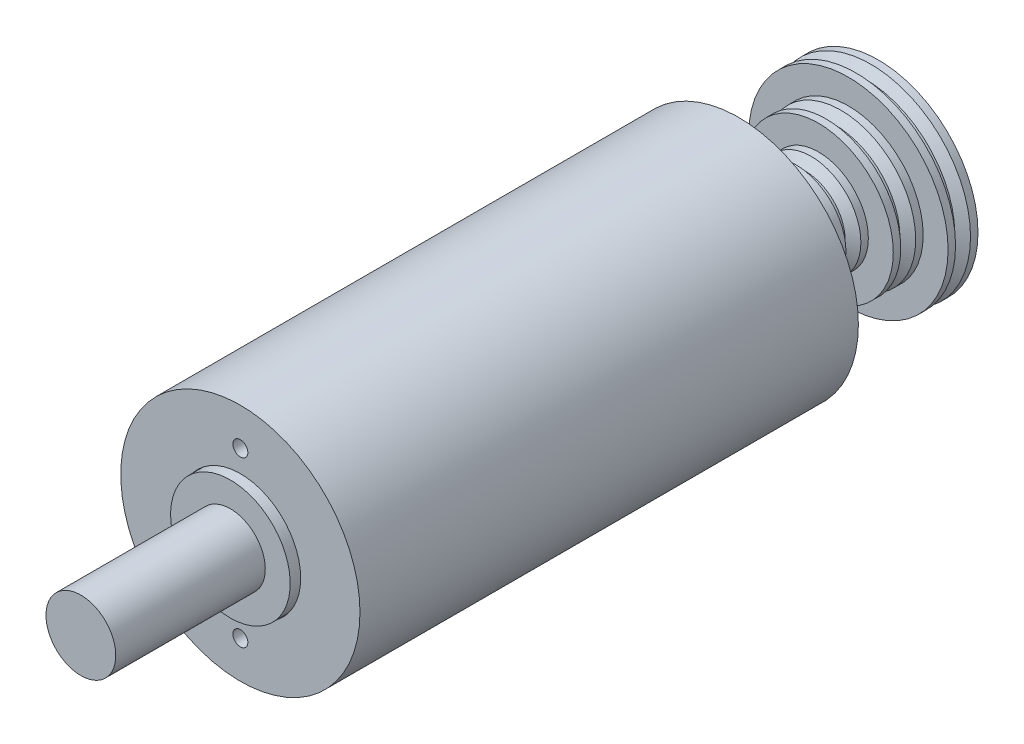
ISO-10303-21;
HEADER;
FILE_DESCRIPTION(('STEP AP214'),'2;1');
FILE_NAME('part.step','',(''),(''),'','','');
FILE_SCHEMA(('AUTOMOTIVE_DESIGN { 1 0 10303 214 1 1 1 1 }'));
ENDSEC;
DATA;
#1=APPLICATION_CONTEXT('core data for automotive mechanical design processes');
#2=APPLICATION_PROTOCOL_DEFINITION('international standard','automotive_design',2000,#1);
#3=PRODUCT_CONTEXT('',#1,'mechanical');
#4=PRODUCT('Part','Part','',(#3));
#5=PRODUCT_RELATED_PRODUCT_CATEGORY('part','',(#4));
#6=PRODUCT_DEFINITION_FORMATION('','',#4);
#7=PRODUCT_DEFINITION_CONTEXT('part definition',#1,'design');
#8=PRODUCT_DEFINITION('design','',#6,#7);
#9=PRODUCT_DEFINITION_SHAPE('','',#8);
#10=(LENGTH_UNIT() NAMED_UNIT(*) SI_UNIT(.MILLI.,.METRE.));
#11=(NAMED_UNIT(*) PLANE_ANGLE_UNIT() SI_UNIT($,.RADIAN.));
#12=(NAMED_UNIT(*) SI_UNIT($,.STERADIAN.) SOLID_ANGLE_UNIT());
#13=UNCERTAINTY_MEASURE_WITH_UNIT(LENGTH_MEASURE(1.E-05),#10,'distance_accuracy_value','');
#14=(GEOMETRIC_REPRESENTATION_CONTEXT(3) GLOBAL_UNCERTAINTY_ASSIGNED_CONTEXT((#13)) GLOBAL_UNIT_ASSIGNED_CONTEXT((#10,
#11,#12)) REPRESENTATION_CONTEXT('',''));
#15=CARTESIAN_POINT('',(0.,0.,0.));
#16=DIRECTION('',(0.,0.,1.));
#17=DIRECTION('',(1.,0.,0.));
#18=AXIS2_PLACEMENT_3D('',#15,#16,#17);
#19=CARTESIAN_POINT('',(0.,0.,126.394277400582));
#20=DIRECTION('',(0.,0.,1.));
#21=DIRECTION('',(0.,-1.,0.));
#22=AXIS2_PLACEMENT_3D('',#19,#20,#21);
#23=CYLINDRICAL_SURFACE('',#22,4.99999999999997);
#24=CARTESIAN_POINT('',(0.,0.,-53.));
#25=DIRECTION('',(0.,0.,1.));
#26=DIRECTION('',(0.,-1.,0.));
#27=AXIS2_PLACEMENT_3D('',#24,#25,#26);
#28=CIRCLE('',#27,4.99999999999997);
#29=CARTESIAN_POINT('',(0.,-4.99999999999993,-53.));
#30=VERTEX_POINT('',#29);
#31=EDGE_CURVE('E92',#30,#30,#28,.T.);
#32=ORIENTED_EDGE('',*,*,#31,.F.);
#33=EDGE_LOOP('',(#32));
#34=FACE_BOUND('',#33,.T.);
#35=CARTESIAN_POINT('',(0.,0.,-54.5));
#36=DIRECTION('',(0.,0.,-1.));
#37=DIRECTION('',(-1.,0.,0.));
#38=AXIS2_PLACEMENT_3D('',#35,#36,#37);
#39=CIRCLE('',#38,4.99999999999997);
#40=CARTESIAN_POINT('',(-4.99999999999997,0.,-54.5));
#41=VERTEX_POINT('',#40);
#42=EDGE_CURVE('E11',#41,#41,#39,.T.);
#43=ORIENTED_EDGE('',*,*,#42,.F.);
#44=EDGE_LOOP('',(#43));
#45=FACE_BOUND('',#44,.T.);
#46=ADVANCED_FACE('F64',(#34,#45),#23,.T.);
#47=CARTESIAN_POINT('',(0.,0.,82.));
#48=DIRECTION('',(0.,0.,-1.));
#49=DIRECTION('',(0.,1.,0.));
#50=AXIS2_PLACEMENT_3D('',#47,#48,#49);
#51=PLANE('',#50);
#52=CARTESIAN_POINT('',(0.,0.,82.));
#53=DIRECTION('',(0.,0.,1.));
#54=DIRECTION('',(0.,-1.,0.));
#55=AXIS2_PLACEMENT_3D('',#52,#53,#54);
#56=CIRCLE('',#55,6.99999999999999);
#57=CARTESIAN_POINT('',(0.,-6.99999999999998,82.));
#58=VERTEX_POINT('',#57);
#59=EDGE_CURVE('E76',#58,#58,#56,.T.);
#60=ORIENTED_EDGE('',*,*,#59,.T.);
#61=EDGE_LOOP('',(#60));
#62=FACE_BOUND('',#61,.T.);
#63=ADVANCED_FACE('F66',(#62),#51,.F.);
#64=CARTESIAN_POINT('',(0.,0.,126.394277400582));
#65=DIRECTION('',(0.,0.,1.));
#66=DIRECTION('',(0.,-1.,0.));
#67=AXIS2_PLACEMENT_3D('',#64,#65,#66);
#68=CYLINDRICAL_SURFACE('',#67,6.99999999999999);
#69=ORIENTED_EDGE('',*,*,#59,.F.);
#70=EDGE_LOOP('',(#69));
#71=FACE_BOUND('',#70,.T.);
#72=CARTESIAN_POINT('',(0.,0.,52.));
#73=DIRECTION('',(0.,0.,1.));
#74=DIRECTION('',(0.,-1.,0.));
#75=AXIS2_PLACEMENT_3D('',#72,#73,#74);
#76=CIRCLE('',#75,6.99999999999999);
#77=CARTESIAN_POINT('',(0.,-6.99999999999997,52.));
#78=VERTEX_POINT('',#77);
#79=EDGE_CURVE('E81',#78,#78,#76,.T.);
#80=ORIENTED_EDGE('',*,*,#79,.T.);
#81=EDGE_LOOP('',(#80));
#82=FACE_BOUND('',#81,.T.);
#83=ADVANCED_FACE('F144',(#71,#82),#68,.T.);
#84=CARTESIAN_POINT('',(0.,7.,52.));
#85=DIRECTION('',(0.,0.,-1.));
#86=DIRECTION('',(0.,1.,0.));
#87=AXIS2_PLACEMENT_3D('',#84,#85,#86);
#88=PLANE('',#87);
#89=ORIENTED_EDGE('',*,*,#79,.F.);
#90=EDGE_LOOP('',(#89));
#91=FACE_BOUND('',#90,.T.);
#92=CARTESIAN_POINT('',(0.,0.,52.));
#93=DIRECTION('',(0.,0.,1.));
#94=DIRECTION('',(0.,-1.,0.));
#95=AXIS2_PLACEMENT_3D('',#92,#93,#94);
#96=CIRCLE('',#95,12.);
#97=CARTESIAN_POINT('',(0.,-12.,52.));
#98=VERTEX_POINT('',#97);
#99=EDGE_CURVE('E138',#98,#98,#96,.T.);
#100=ORIENTED_EDGE('',*,*,#99,.T.);
#101=EDGE_LOOP('',(#100));
#102=FACE_BOUND('',#101,.T.);
#103=ADVANCED_FACE('F146',(#91,#102),#88,.F.);
#104=CARTESIAN_POINT('',(0.,0.,126.394277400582));
#105=DIRECTION('',(0.,0.,1.));
#106=DIRECTION('',(0.,-1.,0.));
#107=AXIS2_PLACEMENT_3D('',#104,#105,#106);
#108=CYLINDRICAL_SURFACE('',#107,12.);
#109=ORIENTED_EDGE('',*,*,#99,.F.);
#110=EDGE_LOOP('',(#109));
#111=FACE_BOUND('',#110,.T.);
#112=CARTESIAN_POINT('',(0.,0.,48.));
#113=DIRECTION('',(0.,0.,1.));
#114=DIRECTION('',(0.,-1.,0.));
#115=AXIS2_PLACEMENT_3D('',#112,#113,#114);
#116=CIRCLE('',#115,12.);
#117=CARTESIAN_POINT('',(0.,-12.,48.));
#118=VERTEX_POINT('',#117);
#119=EDGE_CURVE('E135',#118,#118,#116,.T.);
#120=ORIENTED_EDGE('',*,*,#119,.T.);
#121=EDGE_LOOP('',(#120));
#122=FACE_BOUND('',#121,.T.);
#123=ADVANCED_FACE('F149',(#111,#122),#108,.T.);
#124=CARTESIAN_POINT('',(0.,12.,48.));
#125=DIRECTION('',(0.,0.,1.));
#126=DIRECTION('',(0.,-1.,0.));
#127=AXIS2_PLACEMENT_3D('',#124,#125,#126);
#128=PLANE('',#127);
#129=ORIENTED_EDGE('',*,*,#119,.F.);
#130=EDGE_LOOP('',(#129));
#131=FACE_BOUND('',#130,.T.);
#132=CARTESIAN_POINT('',(0.,0.,48.));
#133=DIRECTION('',(0.,0.,1.));
#134=DIRECTION('',(0.,-1.,0.));
#135=AXIS2_PLACEMENT_3D('',#132,#133,#134);
#136=CIRCLE('',#135,7.39999999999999);
#137=CARTESIAN_POINT('',(0.,-7.39999999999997,48.));
#138=VERTEX_POINT('',#137);
#139=EDGE_CURVE('E132',#138,#138,#136,.T.);
#140=ORIENTED_EDGE('',*,*,#139,.T.);
#141=EDGE_LOOP('',(#140));
#142=FACE_BOUND('',#141,.T.);
#143=ADVANCED_FACE('F155',(#131,#142),#128,.F.);
#144=CARTESIAN_POINT('',(0.,0.,126.394277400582));
#145=DIRECTION('',(0.,0.,1.));
#146=DIRECTION('',(0.,-1.,0.));
#147=AXIS2_PLACEMENT_3D('',#144,#145,#146);
#148=CYLINDRICAL_SURFACE('',#147,7.39999999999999);
#149=ORIENTED_EDGE('',*,*,#139,.F.);
#150=EDGE_LOOP('',(#149));
#151=FACE_BOUND('',#150,.T.);
#152=CARTESIAN_POINT('',(0.,0.,44.));
#153=DIRECTION('',(0.,0.,1.));
#154=DIRECTION('',(0.,-1.,0.));
#155=AXIS2_PLACEMENT_3D('',#152,#153,#154);
#156=CIRCLE('',#155,7.39999999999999);
#157=CARTESIAN_POINT('',(0.,-7.39999999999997,44.));
#158=VERTEX_POINT('',#157);
#159=EDGE_CURVE('E129',#158,#158,#156,.T.);
#160=ORIENTED_EDGE('',*,*,#159,.T.);
#161=EDGE_LOOP('',(#160));
#162=FACE_BOUND('',#161,.T.);
#163=ADVANCED_FACE('F161',(#151,#162),#148,.T.);
#164=CARTESIAN_POINT('',(0.,7.4,44.));
#165=DIRECTION('',(0.,0.,-1.));
#166=DIRECTION('',(0.,1.,0.));
#167=AXIS2_PLACEMENT_3D('',#164,#165,#166);
#168=PLANE('',#167);
#169=ORIENTED_EDGE('',*,*,#159,.F.);
#170=EDGE_LOOP('',(#169));
#171=FACE_BOUND('',#170,.T.);
#172=CARTESIAN_POINT('',(0.,0.,44.));
#173=DIRECTION('',(0.,0.,1.));
#174=DIRECTION('',(0.,-1.,0.));
#175=AXIS2_PLACEMENT_3D('',#172,#173,#174);
#176=CIRCLE('',#175,11.);
#177=CARTESIAN_POINT('',(0.,-11.,44.));
#178=VERTEX_POINT('',#177);
#179=EDGE_CURVE('E126',#178,#178,#176,.T.);
#180=ORIENTED_EDGE('',*,*,#179,.T.);
#181=EDGE_LOOP('',(#180));
#182=FACE_BOUND('',#181,.T.);
#183=ADVANCED_FACE('F167',(#171,#182),#168,.F.);
#184=CARTESIAN_POINT('',(0.,0.,126.394277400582));
#185=DIRECTION('',(0.,0.,1.));
#186=DIRECTION('',(0.,-1.,0.));
#187=AXIS2_PLACEMENT_3D('',#184,#185,#186);
#188=CYLINDRICAL_SURFACE('',#187,11.);
#189=ORIENTED_EDGE('',*,*,#179,.F.);
#190=EDGE_LOOP('',(#189));
#191=FACE_BOUND('',#190,.T.);
#192=CARTESIAN_POINT('',(0.,0.,40.));
#193=DIRECTION('',(0.,0.,1.));
#194=DIRECTION('',(1.,0.,0.));
#195=AXIS2_PLACEMENT_3D('',#192,#193,#194);
#196=CIRCLE('',#195,11.);
#197=CARTESIAN_POINT('',(11.,0.,40.));
#198=VERTEX_POINT('',#197);
#199=EDGE_CURVE('E87',#198,#198,#196,.T.);
#200=ORIENTED_EDGE('',*,*,#199,.T.);
#201=EDGE_LOOP('',(#200));
#202=FACE_BOUND('',#201,.T.);
#203=ADVANCED_FACE('F173',(#191,#202),#188,.T.);
#204=CARTESIAN_POINT('',(0.,0.,-39.));
#205=DIRECTION('',(0.,0.,-1.));
#206=DIRECTION('',(-1.,0.,0.));
#207=AXIS2_PLACEMENT_3D('',#204,#205,#206);
#208=PLANE('',#207);
#209=CARTESIAN_POINT('',(0.,0.,-39.));
#210=DIRECTION('',(0.,0.,-1.));
#211=DIRECTION('',(0.,1.,0.));
#212=AXIS2_PLACEMENT_3D('',#209,#210,#211);
#213=CIRCLE('',#212,8.);
#214=CARTESIAN_POINT('',(0.,8.00000000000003,-39.));
#215=VERTEX_POINT('',#214);
#216=EDGE_CURVE('E1279',#215,#215,#213,.T.);
#217=ORIENTED_EDGE('',*,*,#216,.F.);
#218=EDGE_LOOP('',(#217));
#219=FACE_BOUND('',#218,.T.);
#220=CARTESIAN_POINT('',(0.,0.,-39.));
#221=DIRECTION('',(0.,0.,-1.));
#222=DIRECTION('',(0.,1.,0.));
#223=AXIS2_PLACEMENT_3D('',#220,#221,#222);
#224=CIRCLE('',#223,14.1);
#225=CARTESIAN_POINT('',(0.,14.1,-39.));
#226=VERTEX_POINT('',#225);
#227=EDGE_CURVE('E1377',#226,#226,#224,.T.);
#228=ORIENTED_EDGE('',*,*,#227,.T.);
#229=EDGE_LOOP('',(#228));
#230=FACE_BOUND('',#229,.T.);
#231=ADVANCED_FACE('F179',(#219,#230),#208,.T.);
#232=CARTESIAN_POINT('',(0.,0.,40.));
#233=DIRECTION('',(0.,0.,1.));
#234=DIRECTION('',(1.,0.,0.));
#235=AXIS2_PLACEMENT_3D('',#232,#233,#234);
#236=CYLINDRICAL_SURFACE('',#235,12.1);
#237=CARTESIAN_POINT('',(0.,0.,50.));
#238=DIRECTION('',(0.,0.,1.));
#239=DIRECTION('',(1.,0.,0.));
#240=AXIS2_PLACEMENT_3D('',#237,#238,#239);
#241=CIRCLE('',#240,12.1);
#242=CARTESIAN_POINT('',(12.1,0.,50.));
#243=VERTEX_POINT('',#242);
#244=EDGE_CURVE('E1360',#243,#243,#241,.T.);
#245=ORIENTED_EDGE('',*,*,#244,.T.);
#246=EDGE_LOOP('',(#245));
#247=FACE_BOUND('',#246,.T.);
#248=CARTESIAN_POINT('',(0.,0.,41.));
#249=DIRECTION('',(0.,0.,-1.));
#250=DIRECTION('',(-1.,0.,0.));
#251=AXIS2_PLACEMENT_3D('',#248,#249,#250);
#252=CIRCLE('',#251,12.1);
#253=CARTESIAN_POINT('',(-12.1,0.,41.));
#254=VERTEX_POINT('',#253);
#255=EDGE_CURVE('E1348',#254,#254,#252,.F.);
#256=ORIENTED_EDGE('',*,*,#255,.F.);
#257=EDGE_LOOP('',(#256));
#258=FACE_BOUND('',#257,.T.);
#259=ADVANCED_FACE('F320',(#247,#258),#236,.F.);
#260=CARTESIAN_POINT('',(0.,0.,50.));
#261=DIRECTION('',(0.,0.,1.));
#262=DIRECTION('',(1.,0.,0.));
#263=AXIS2_PLACEMENT_3D('',#260,#261,#262);
#264=PLANE('',#263);
#265=CARTESIAN_POINT('',(0.,-16.5,50.));
#266=DIRECTION('',(0.,0.,1.));
#267=DIRECTION('',(1.,0.,0.));
#268=AXIS2_PLACEMENT_3D('',#265,#266,#267);
#269=CIRCLE('',#268,1.5);
#270=CARTESIAN_POINT('',(1.5,-16.5,50.));
#271=VERTEX_POINT('',#270);
#272=EDGE_CURVE('E1361',#271,#271,#269,.T.);
#273=ORIENTED_EDGE('',*,*,#272,.F.);
#274=EDGE_LOOP('',(#273));
#275=FACE_BOUND('',#274,.T.);
#276=CARTESIAN_POINT('',(0.,16.5,50.));
#277=DIRECTION('',(0.,0.,1.));
#278=DIRECTION('',(1.,0.,0.));
#279=AXIS2_PLACEMENT_3D('',#276,#277,#278);
#280=CIRCLE('',#279,1.5);
#281=CARTESIAN_POINT('',(1.5,16.5,50.));
#282=VERTEX_POINT('',#281);
#283=EDGE_CURVE('E1356',#282,#282,#280,.T.);
#284=ORIENTED_EDGE('',*,*,#283,.F.);
#285=EDGE_LOOP('',(#284));
#286=FACE_BOUND('',#285,.T.);
#287=ORIENTED_EDGE('',*,*,#244,.F.);
#288=EDGE_LOOP('',(#287));
#289=FACE_BOUND('',#288,.T.);
#290=CARTESIAN_POINT('',(0.,0.,50.));
#291=DIRECTION('',(0.,0.,1.));
#292=DIRECTION('',(1.,0.,0.));
#293=AXIS2_PLACEMENT_3D('',#290,#291,#292);
#294=CIRCLE('',#293,24.);
#295=CARTESIAN_POINT('',(24.,0.,50.));
#296=VERTEX_POINT('',#295);
#297=EDGE_CURVE('E1327',#296,#296,#294,.T.);
#298=ORIENTED_EDGE('',*,*,#297,.T.);
#299=EDGE_LOOP('',(#298));
#300=FACE_BOUND('',#299,.T.);
#301=ADVANCED_FACE('F328',(#275,#286,#289,#300),#264,.T.);
#302=CARTESIAN_POINT('',(0.,16.5,45.));
#303=DIRECTION('',(0.,0.,1.));
#304=DIRECTION('',(1.,0.,0.));
#305=AXIS2_PLACEMENT_3D('',#302,#303,#304);
#306=CYLINDRICAL_SURFACE('',#305,1.5);
#307=CARTESIAN_POINT('',(0.,16.5,45.));
#308=DIRECTION('',(0.,0.,1.));
#309=DIRECTION('',(1.,0.,0.));
#310=AXIS2_PLACEMENT_3D('',#307,#308,#309);
#311=CIRCLE('',#310,1.5);
#312=CARTESIAN_POINT('',(1.5,16.5,45.));
#313=VERTEX_POINT('',#312);
#314=EDGE_CURVE('E1364',#313,#313,#311,.T.);
#315=ORIENTED_EDGE('',*,*,#314,.F.);
#316=EDGE_LOOP('',(#315));
#317=FACE_BOUND('',#316,.T.);
#318=ORIENTED_EDGE('',*,*,#283,.T.);
#319=EDGE_LOOP('',(#318));
#320=FACE_BOUND('',#319,.T.);
#321=ADVANCED_FACE('F335',(#317,#320),#306,.F.);
#322=CARTESIAN_POINT('',(0.,16.5,45.));
#323=DIRECTION('',(0.,0.,1.));
#324=DIRECTION('',(1.,0.,0.));
#325=AXIS2_PLACEMENT_3D('',#322,#323,#324);
#326=PLANE('',#325);
#327=ORIENTED_EDGE('',*,*,#314,.T.);
#328=EDGE_LOOP('',(#327));
#329=FACE_BOUND('',#328,.T.);
#330=ADVANCED_FACE('F342',(#329),#326,.T.);
#331=CARTESIAN_POINT('',(0.,-16.5,45.));
#332=DIRECTION('',(0.,0.,1.));
#333=DIRECTION('',(1.,0.,0.));
#334=AXIS2_PLACEMENT_3D('',#331,#332,#333);
#335=CYLINDRICAL_SURFACE('',#334,1.5);
#336=CARTESIAN_POINT('',(0.,-16.5,45.));
#337=DIRECTION('',(0.,0.,1.));
#338=DIRECTION('',(1.,0.,0.));
#339=AXIS2_PLACEMENT_3D('',#336,#337,#338);
#340=CIRCLE('',#339,1.5);
#341=CARTESIAN_POINT('',(1.5,-16.5,45.));
#342=VERTEX_POINT('',#341);
#343=EDGE_CURVE('E1357',#342,#342,#340,.T.);
#344=ORIENTED_EDGE('',*,*,#343,.F.);
#345=EDGE_LOOP('',(#344));
#346=FACE_BOUND('',#345,.T.);
#347=ORIENTED_EDGE('',*,*,#272,.T.);
#348=EDGE_LOOP('',(#347));
#349=FACE_BOUND('',#348,.T.);
#350=ADVANCED_FACE('F349',(#346,#349),#335,.F.);
#351=CARTESIAN_POINT('',(0.,-16.5,45.));
#352=DIRECTION('',(0.,0.,1.));
#353=DIRECTION('',(1.,0.,0.));
#354=AXIS2_PLACEMENT_3D('',#351,#352,#353);
#355=PLANE('',#354);
#356=ORIENTED_EDGE('',*,*,#343,.T.);
#357=EDGE_LOOP('',(#356));
#358=FACE_BOUND('',#357,.T.);
#359=ADVANCED_FACE('F356',(#358),#355,.T.);
#360=CARTESIAN_POINT('',(0.,0.,41.));
#361=DIRECTION('',(0.,0.,-1.));
#362=DIRECTION('',(-1.,0.,0.));
#363=AXIS2_PLACEMENT_3D('',#360,#361,#362);
#364=CYLINDRICAL_SURFACE('',#363,17.5);
#365=CARTESIAN_POINT('',(0.,0.,41.));
#366=DIRECTION('',(0.,0.,-1.));
#367=DIRECTION('',(-1.,0.,0.));
#368=AXIS2_PLACEMENT_3D('',#365,#366,#367);
#369=CIRCLE('',#368,17.5);
#370=CARTESIAN_POINT('',(-17.5,0.,41.));
#371=VERTEX_POINT('',#370);
#372=EDGE_CURVE('E1353',#371,#371,#369,.T.);
#373=ORIENTED_EDGE('',*,*,#372,.F.);
#374=EDGE_LOOP('',(#373));
#375=FACE_BOUND('',#374,.T.);
#376=CARTESIAN_POINT('',(0.,0.,40.));
#377=DIRECTION('',(0.,0.,1.));
#378=DIRECTION('',(1.,0.,0.));
#379=AXIS2_PLACEMENT_3D('',#376,#377,#378);
#380=CIRCLE('',#379,17.5);
#381=CARTESIAN_POINT('',(17.5,0.,40.));
#382=VERTEX_POINT('',#381);
#383=EDGE_CURVE('E1341',#382,#382,#380,.F.);
#384=ORIENTED_EDGE('',*,*,#383,.T.);
#385=EDGE_LOOP('',(#384));
#386=FACE_BOUND('',#385,.T.);
#387=ADVANCED_FACE('F363',(#375,#386),#364,.F.);
#388=CARTESIAN_POINT('',(0.,0.,41.));
#389=DIRECTION('',(0.,0.,-1.));
#390=DIRECTION('',(-1.,0.,0.));
#391=AXIS2_PLACEMENT_3D('',#388,#389,#390);
#392=PLANE('',#391);
#393=ORIENTED_EDGE('',*,*,#255,.T.);
#394=EDGE_LOOP('',(#393));
#395=FACE_BOUND('',#394,.T.);
#396=ORIENTED_EDGE('',*,*,#372,.T.);
#397=EDGE_LOOP('',(#396));
#398=FACE_BOUND('',#397,.T.);
#399=ADVANCED_FACE('F370',(#395,#398),#392,.T.);
#400=CARTESIAN_POINT('',(0.,0.,50.));
#401=DIRECTION('',(0.,0.,-1.));
#402=DIRECTION('',(-1.,0.,0.));
#403=AXIS2_PLACEMENT_3D('',#400,#401,#402);
#404=CYLINDRICAL_SURFACE('',#403,24.);
#405=ORIENTED_EDGE('',*,*,#297,.F.);
#406=EDGE_LOOP('',(#405));
#407=FACE_BOUND('',#406,.T.);
#408=CARTESIAN_POINT('',(0.,0.,-50.));
#409=DIRECTION('',(0.,0.,1.));
#410=DIRECTION('',(1.,0.,0.));
#411=AXIS2_PLACEMENT_3D('',#408,#409,#410);
#412=CIRCLE('',#411,24.);
#413=CARTESIAN_POINT('',(24.,0.,-50.));
#414=VERTEX_POINT('',#413);
#415=EDGE_CURVE('E1326',#414,#414,#412,.T.);
#416=ORIENTED_EDGE('',*,*,#415,.T.);
#417=EDGE_LOOP('',(#416));
#418=FACE_BOUND('',#417,.T.);
#419=ADVANCED_FACE('F377',(#407,#418),#404,.T.);
#420=CARTESIAN_POINT('',(0.,-8.74999999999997,-44.));
#421=DIRECTION('',(0.,0.,-1.));
#422=DIRECTION('',(0.,1.,0.));
#423=AXIS2_PLACEMENT_3D('',#420,#421,#422);
#424=PLANE('',#423);
#425=CARTESIAN_POINT('',(0.,-8.74999999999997,-44.));
#426=DIRECTION('',(0.,0.,-1.));
#427=DIRECTION('',(0.,1.,0.));
#428=AXIS2_PLACEMENT_3D('',#425,#426,#427);
#429=CIRCLE('',#428,1.6);
#430=CARTESIAN_POINT('',(0.,-7.14999999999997,-44.));
#431=VERTEX_POINT('',#430);
#432=EDGE_CURVE('E1285',#431,#431,#429,.T.);
#433=ORIENTED_EDGE('',*,*,#432,.T.);
#434=EDGE_LOOP('',(#433));
#435=FACE_BOUND('',#434,.T.);
#436=ADVANCED_FACE('F384',(#435),#424,.T.);
#437=CARTESIAN_POINT('',(0.,-8.74999999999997,-44.));
#438=DIRECTION('',(0.,0.,-1.));
#439=DIRECTION('',(0.,1.,0.));
#440=AXIS2_PLACEMENT_3D('',#437,#438,#439);
#441=CYLINDRICAL_SURFACE('',#440,1.6);
#442=ORIENTED_EDGE('',*,*,#432,.F.);
#443=EDGE_LOOP('',(#442));
#444=FACE_BOUND('',#443,.T.);
#445=CARTESIAN_POINT('',(0.,-8.74999999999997,-49.));
#446=DIRECTION('',(0.,0.,-1.));
#447=DIRECTION('',(0.,1.,0.));
#448=AXIS2_PLACEMENT_3D('',#445,#446,#447);
#449=CIRCLE('',#448,1.6);
#450=CARTESIAN_POINT('',(0.,-7.14999999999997,-49.));
#451=VERTEX_POINT('',#450);
#452=EDGE_CURVE('E1289',#451,#451,#449,.T.);
#453=ORIENTED_EDGE('',*,*,#452,.T.);
#454=EDGE_LOOP('',(#453));
#455=FACE_BOUND('',#454,.T.);
#456=ADVANCED_FACE('F391',(#444,#455),#441,.F.);
#457=CARTESIAN_POINT('',(0.,8.74999999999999,-44.));
#458=DIRECTION('',(0.,0.,-1.));
#459=DIRECTION('',(0.,1.,0.));
#460=AXIS2_PLACEMENT_3D('',#457,#458,#459);
#461=PLANE('',#460);
#462=CARTESIAN_POINT('',(0.,8.74999999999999,-44.));
#463=DIRECTION('',(0.,0.,-1.));
#464=DIRECTION('',(0.,1.,0.));
#465=AXIS2_PLACEMENT_3D('',#462,#463,#464);
#466=CIRCLE('',#465,1.6);
#467=CARTESIAN_POINT('',(0.,10.35,-44.));
#468=VERTEX_POINT('',#467);
#469=EDGE_CURVE('E1292',#468,#468,#466,.T.);
#470=ORIENTED_EDGE('',*,*,#469,.T.);
#471=EDGE_LOOP('',(#470));
#472=FACE_BOUND('',#471,.T.);
#473=ADVANCED_FACE('F398',(#472),#461,.T.);
#474=CARTESIAN_POINT('',(0.,8.74999999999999,-44.));
#475=DIRECTION('',(0.,0.,-1.));
#476=DIRECTION('',(0.,1.,0.));
#477=AXIS2_PLACEMENT_3D('',#474,#475,#476);
#478=CYLINDRICAL_SURFACE('',#477,1.6);
#479=ORIENTED_EDGE('',*,*,#469,.F.);
#480=EDGE_LOOP('',(#479));
#481=FACE_BOUND('',#480,.T.);
#482=CARTESIAN_POINT('',(0.,8.74999999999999,-49.));
#483=DIRECTION('',(0.,0.,-1.));
#484=DIRECTION('',(0.,1.,0.));
#485=AXIS2_PLACEMENT_3D('',#482,#483,#484);
#486=CIRCLE('',#485,1.6);
#487=CARTESIAN_POINT('',(0.,10.35,-49.));
#488=VERTEX_POINT('',#487);
#489=EDGE_CURVE('E1295',#488,#488,#486,.T.);
#490=ORIENTED_EDGE('',*,*,#489,.T.);
#491=EDGE_LOOP('',(#490));
#492=FACE_BOUND('',#491,.T.);
#493=ADVANCED_FACE('F405',(#481,#492),#478,.F.);
#494=CARTESIAN_POINT('',(0.,0.,-49.));
#495=DIRECTION('',(0.,0.,1.));
#496=DIRECTION('',(0.,-1.,0.));
#497=AXIS2_PLACEMENT_3D('',#494,#495,#496);
#498=CYLINDRICAL_SURFACE('',#497,12.);
#499=CARTESIAN_POINT('',(0.,0.,-49.));
#500=DIRECTION('',(0.,0.,-1.));
#501=DIRECTION('',(0.,1.,0.));
#502=AXIS2_PLACEMENT_3D('',#499,#500,#501);
#503=CIRCLE('',#502,12.);
#504=CARTESIAN_POINT('',(0.,12.,-49.));
#505=VERTEX_POINT('',#504);
#506=EDGE_CURVE('E1298',#505,#505,#503,.T.);
#507=ORIENTED_EDGE('',*,*,#506,.F.);
#508=EDGE_LOOP('',(#507));
#509=FACE_BOUND('',#508,.T.);
#510=CARTESIAN_POINT('',(0.,0.,-41.));
#511=DIRECTION('',(0.,0.,-1.));
#512=DIRECTION('',(0.,1.,0.));
#513=AXIS2_PLACEMENT_3D('',#510,#511,#512);
#514=CIRCLE('',#513,12.);
#515=CARTESIAN_POINT('',(0.,12.,-41.));
#516=VERTEX_POINT('',#515);
#517=EDGE_CURVE('E1288',#516,#516,#514,.T.);
#518=ORIENTED_EDGE('',*,*,#517,.T.);
#519=EDGE_LOOP('',(#518));
#520=FACE_BOUND('',#519,.T.);
#521=ADVANCED_FACE('F412',(#509,#520),#498,.T.);
#522=CARTESIAN_POINT('',(0.,0.,-41.));
#523=DIRECTION('',(0.,0.,-1.));
#524=DIRECTION('',(0.,1.,0.));
#525=AXIS2_PLACEMENT_3D('',#522,#523,#524);
#526=PLANE('',#525);
#527=CARTESIAN_POINT('',(0.,0.,-41.));
#528=DIRECTION('',(0.,0.,-1.));
#529=DIRECTION('',(0.,1.,0.));
#530=AXIS2_PLACEMENT_3D('',#527,#528,#529);
#531=CIRCLE('',#530,8.);
#532=CARTESIAN_POINT('',(0.,8.00000000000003,-41.));
#533=VERTEX_POINT('',#532);
#534=EDGE_CURVE('E1309',#533,#533,#531,.T.);
#535=ORIENTED_EDGE('',*,*,#534,.T.);
#536=EDGE_LOOP('',(#535));
#537=FACE_BOUND('',#536,.T.);
#538=ORIENTED_EDGE('',*,*,#517,.F.);
#539=EDGE_LOOP('',(#538));
#540=FACE_BOUND('',#539,.T.);
#541=ADVANCED_FACE('F419',(#537,#540),#526,.F.);
#542=CARTESIAN_POINT('',(0.,0.,-49.));
#543=DIRECTION('',(0.,0.,-1.));
#544=DIRECTION('',(0.,1.,0.));
#545=AXIS2_PLACEMENT_3D('',#542,#543,#544);
#546=PLANE('',#545);
#547=CARTESIAN_POINT('',(0.,0.,-49.));
#548=DIRECTION('',(0.,0.,-1.));
#549=DIRECTION('',(0.,1.,0.));
#550=AXIS2_PLACEMENT_3D('',#547,#548,#549);
#551=CIRCLE('',#550,5.94999999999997);
#552=CARTESIAN_POINT('',(0.,5.95,-49.));
#553=VERTEX_POINT('',#552);
#554=EDGE_CURVE('E84',#553,#553,#551,.T.);
#555=ORIENTED_EDGE('',*,*,#554,.F.);
#556=EDGE_LOOP('',(#555));
#557=FACE_BOUND('',#556,.T.);
#558=ORIENTED_EDGE('',*,*,#452,.F.);
#559=EDGE_LOOP('',(#558));
#560=FACE_BOUND('',#559,.T.);
#561=ORIENTED_EDGE('',*,*,#489,.F.);
#562=EDGE_LOOP('',(#561));
#563=FACE_BOUND('',#562,.T.);
#564=ORIENTED_EDGE('',*,*,#506,.T.);
#565=EDGE_LOOP('',(#564));
#566=FACE_BOUND('',#565,.T.);
#567=ADVANCED_FACE('F426',(#557,#560,#563,#566),#546,.T.);
#568=CARTESIAN_POINT('',(0.,0.,-41.));
#569=DIRECTION('',(0.,0.,1.));
#570=DIRECTION('',(0.,-1.,0.));
#571=AXIS2_PLACEMENT_3D('',#568,#569,#570);
#572=CYLINDRICAL_SURFACE('',#571,8.);
#573=ORIENTED_EDGE('',*,*,#534,.F.);
#574=EDGE_LOOP('',(#573));
#575=FACE_BOUND('',#574,.T.);
#576=ORIENTED_EDGE('',*,*,#216,.T.);
#577=EDGE_LOOP('',(#576));
#578=FACE_BOUND('',#577,.T.);
#579=ADVANCED_FACE('F433',(#575,#578),#572,.T.);
#580=CARTESIAN_POINT('',(0.,0.,5.54772721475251));
#581=DIRECTION('',(0.,0.,-1.));
#582=DIRECTION('',(-1.,0.,0.));
#583=AXIS2_PLACEMENT_3D('',#580,#581,#582);
#584=CYLINDRICAL_SURFACE('',#583,14.1);
#585=ORIENTED_EDGE('',*,*,#227,.F.);
#586=EDGE_LOOP('',(#585));
#587=FACE_BOUND('',#586,.T.);
#588=CARTESIAN_POINT('',(0.,0.,-40.));
#589=DIRECTION('',(0.,0.,1.));
#590=DIRECTION('',(1.,0.,0.));
#591=AXIS2_PLACEMENT_3D('',#588,#589,#590);
#592=CIRCLE('',#591,14.1);
#593=CARTESIAN_POINT('',(14.1,0.,-40.));
#594=VERTEX_POINT('',#593);
#595=EDGE_CURVE('E1374',#594,#594,#592,.T.);
#596=ORIENTED_EDGE('',*,*,#595,.F.);
#597=EDGE_LOOP('',(#596));
#598=FACE_BOUND('',#597,.T.);
#599=ADVANCED_FACE('F440',(#587,#598),#584,.F.);
#600=CARTESIAN_POINT('',(-16.5,0.,-45.));
#601=DIRECTION('',(0.,0.,-1.));
#602=DIRECTION('',(-1.,0.,0.));
#603=AXIS2_PLACEMENT_3D('',#600,#601,#602);
#604=PLANE('',#603);
#605=CARTESIAN_POINT('',(-16.5,0.,-45.));
#606=DIRECTION('',(0.,0.,-1.));
#607=DIRECTION('',(-1.,0.,0.));
#608=AXIS2_PLACEMENT_3D('',#605,#606,#607);
#609=CIRCLE('',#608,2.5);
#610=CARTESIAN_POINT('',(-19.,0.,-45.));
#611=VERTEX_POINT('',#610);
#612=EDGE_CURVE('E1381',#611,#611,#609,.T.);
#613=ORIENTED_EDGE('',*,*,#612,.T.);
#614=EDGE_LOOP('',(#613));
#615=FACE_BOUND('',#614,.T.);
#616=ADVANCED_FACE('F446',(#615),#604,.T.);
#617=CARTESIAN_POINT('',(-16.5,0.,-45.));
#618=DIRECTION('',(0.,0.,-1.));
#619=DIRECTION('',(-1.,0.,0.));
#620=AXIS2_PLACEMENT_3D('',#617,#618,#619);
#621=CYLINDRICAL_SURFACE('',#620,2.5);
#622=ORIENTED_EDGE('',*,*,#612,.F.);
#623=EDGE_LOOP('',(#622));
#624=FACE_BOUND('',#623,.T.);
#625=CARTESIAN_POINT('',(-16.5,0.,-50.));
#626=DIRECTION('',(0.,0.,-1.));
#627=DIRECTION('',(-1.,0.,0.));
#628=AXIS2_PLACEMENT_3D('',#625,#626,#627);
#629=CIRCLE('',#628,2.5);
#630=CARTESIAN_POINT('',(-19.,0.,-50.));
#631=VERTEX_POINT('',#630);
#632=EDGE_CURVE('E1385',#631,#631,#629,.T.);
#633=ORIENTED_EDGE('',*,*,#632,.T.);
#634=EDGE_LOOP('',(#633));
#635=FACE_BOUND('',#634,.T.);
#636=ADVANCED_FACE('F453',(#624,#635),#621,.F.);
#637=CARTESIAN_POINT('',(16.5,0.,-45.));
#638=DIRECTION('',(0.,0.,-1.));
#639=DIRECTION('',(-1.,0.,0.));
#640=AXIS2_PLACEMENT_3D('',#637,#638,#639);
#641=PLANE('',#640);
#642=CARTESIAN_POINT('',(16.5,0.,-45.));
#643=DIRECTION('',(0.,0.,-1.));
#644=DIRECTION('',(-1.,0.,0.));
#645=AXIS2_PLACEMENT_3D('',#642,#643,#644);
#646=CIRCLE('',#645,2.5);
#647=CARTESIAN_POINT('',(14.,0.,-45.));
#648=VERTEX_POINT('',#647);
#649=EDGE_CURVE('E1380',#648,#648,#646,.T.);
#650=ORIENTED_EDGE('',*,*,#649,.T.);
#651=EDGE_LOOP('',(#650));
#652=FACE_BOUND('',#651,.T.);
#653=ADVANCED_FACE('F460',(#652),#641,.T.);
#654=CARTESIAN_POINT('',(16.5,0.,-45.));
#655=DIRECTION('',(0.,0.,-1.));
#656=DIRECTION('',(-1.,0.,0.));
#657=AXIS2_PLACEMENT_3D('',#654,#655,#656);
#658=CYLINDRICAL_SURFACE('',#657,2.5);
#659=ORIENTED_EDGE('',*,*,#649,.F.);
#660=EDGE_LOOP('',(#659));
#661=FACE_BOUND('',#660,.T.);
#662=CARTESIAN_POINT('',(16.5,0.,-50.));
#663=DIRECTION('',(0.,0.,-1.));
#664=DIRECTION('',(-1.,0.,0.));
#665=AXIS2_PLACEMENT_3D('',#662,#663,#664);
#666=CIRCLE('',#665,2.5);
#667=CARTESIAN_POINT('',(14.,0.,-50.));
#668=VERTEX_POINT('',#667);
#669=EDGE_CURVE('E1388',#668,#668,#666,.T.);
#670=ORIENTED_EDGE('',*,*,#669,.T.);
#671=EDGE_LOOP('',(#670));
#672=FACE_BOUND('',#671,.T.);
#673=ADVANCED_FACE('F467',(#661,#672),#658,.F.);
#674=CARTESIAN_POINT('',(0.,0.,-40.));
#675=DIRECTION('',(0.,0.,-1.));
#676=DIRECTION('',(-1.,0.,0.));
#677=AXIS2_PLACEMENT_3D('',#674,#675,#676);
#678=CYLINDRICAL_SURFACE('',#677,12.1);
#679=CARTESIAN_POINT('',(0.,0.,-40.));
#680=DIRECTION('',(0.,0.,-1.));
#681=DIRECTION('',(-1.,0.,0.));
#682=AXIS2_PLACEMENT_3D('',#679,#680,#681);
#683=CIRCLE('',#682,12.1);
#684=CARTESIAN_POINT('',(-12.1,0.,-40.));
#685=VERTEX_POINT('',#684);
#686=EDGE_CURVE('E1393',#685,#685,#683,.T.);
#687=ORIENTED_EDGE('',*,*,#686,.F.);
#688=EDGE_LOOP('',(#687));
#689=FACE_BOUND('',#688,.T.);
#690=CARTESIAN_POINT('',(0.,0.,-50.));
#691=DIRECTION('',(0.,0.,-1.));
#692=DIRECTION('',(-1.,0.,0.));
#693=AXIS2_PLACEMENT_3D('',#690,#691,#692);
#694=CIRCLE('',#693,12.1);
#695=CARTESIAN_POINT('',(-12.1,0.,-50.));
#696=VERTEX_POINT('',#695);
#697=EDGE_CURVE('E1384',#696,#696,#694,.T.);
#698=ORIENTED_EDGE('',*,*,#697,.T.);
#699=EDGE_LOOP('',(#698));
#700=FACE_BOUND('',#699,.T.);
#701=ADVANCED_FACE('F474',(#689,#700),#678,.F.);
#702=CARTESIAN_POINT('',(0.,0.,-50.));
#703=DIRECTION('',(0.,0.,-1.));
#704=DIRECTION('',(-1.,0.,0.));
#705=AXIS2_PLACEMENT_3D('',#702,#703,#704);
#706=PLANE('',#705);
#707=ORIENTED_EDGE('',*,*,#632,.F.);
#708=EDGE_LOOP('',(#707));
#709=FACE_BOUND('',#708,.T.);
#710=ORIENTED_EDGE('',*,*,#669,.F.);
#711=EDGE_LOOP('',(#710));
#712=FACE_BOUND('',#711,.T.);
#713=ORIENTED_EDGE('',*,*,#697,.F.);
#714=EDGE_LOOP('',(#713));
#715=FACE_BOUND('',#714,.T.);
#716=ORIENTED_EDGE('',*,*,#415,.F.);
#717=EDGE_LOOP('',(#716));
#718=FACE_BOUND('',#717,.T.);
#719=ADVANCED_FACE('F197',(#709,#712,#715,#718),#706,.T.);
#720=CARTESIAN_POINT('',(0.,0.,-40.));
#721=DIRECTION('',(0.,0.,-1.));
#722=DIRECTION('',(-1.,0.,0.));
#723=AXIS2_PLACEMENT_3D('',#720,#721,#722);
#724=PLANE('',#723);
#725=ORIENTED_EDGE('',*,*,#686,.T.);
#726=EDGE_LOOP('',(#725));
#727=FACE_BOUND('',#726,.T.);
#728=ORIENTED_EDGE('',*,*,#595,.T.);
#729=EDGE_LOOP('',(#728));
#730=FACE_BOUND('',#729,.T.);
#731=ADVANCED_FACE('F186',(#727,#730),#724,.F.);
#732=CARTESIAN_POINT('',(0.,0.,40.));
#733=DIRECTION('',(0.,0.,1.));
#734=DIRECTION('',(1.,0.,0.));
#735=AXIS2_PLACEMENT_3D('',#732,#733,#734);
#736=PLANE('',#735);
#737=ORIENTED_EDGE('',*,*,#383,.F.);
#738=EDGE_LOOP('',(#737));
#739=FACE_BOUND('',#738,.T.);
#740=ORIENTED_EDGE('',*,*,#199,.F.);
#741=EDGE_LOOP('',(#740));
#742=FACE_BOUND('',#741,.T.);
#743=ADVANCED_FACE('F183',(#739,#742),#736,.T.);
#744=CARTESIAN_POINT('',(0.,5.95,-53.));
#745=DIRECTION('',(0.,0.,1.));
#746=DIRECTION('',(0.,-1.,0.));
#747=AXIS2_PLACEMENT_3D('',#744,#745,#746);
#748=PLANE('',#747);
#749=CARTESIAN_POINT('',(0.,0.,-53.));
#750=DIRECTION('',(0.,0.,1.));
#751=DIRECTION('',(0.,-1.,0.));
#752=AXIS2_PLACEMENT_3D('',#749,#750,#751);
#753=CIRCLE('',#752,5.94999999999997);
#754=CARTESIAN_POINT('',(0.,-5.94999999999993,-53.));
#755=VERTEX_POINT('',#754);
#756=EDGE_CURVE('E105',#755,#755,#753,.T.);
#757=ORIENTED_EDGE('',*,*,#756,.F.);
#758=EDGE_LOOP('',(#757));
#759=FACE_BOUND('',#758,.T.);
#760=ORIENTED_EDGE('',*,*,#31,.T.);
#761=EDGE_LOOP('',(#760));
#762=FACE_BOUND('',#761,.T.);
#763=ADVANCED_FACE('F185',(#759,#762),#748,.F.);
#764=CARTESIAN_POINT('',(0.,0.,126.394277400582));
#765=DIRECTION('',(0.,0.,1.));
#766=DIRECTION('',(0.,-1.,0.));
#767=AXIS2_PLACEMENT_3D('',#764,#765,#766);
#768=CYLINDRICAL_SURFACE('',#767,5.94999999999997);
#769=ORIENTED_EDGE('',*,*,#554,.T.);
#770=EDGE_LOOP('',(#769));
#771=FACE_BOUND('',#770,.T.);
#772=ORIENTED_EDGE('',*,*,#756,.T.);
#773=EDGE_LOOP('',(#772));
#774=FACE_BOUND('',#773,.T.);
#775=ADVANCED_FACE('F194',(#771,#774),#768,.T.);
#776=CARTESIAN_POINT('',(0.,0.,-50.5678933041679));
#777=DIRECTION('',(0.,0.,1.));
#778=DIRECTION('',(1.,0.,0.));
#779=AXIS2_PLACEMENT_3D('',#776,#777,#778);
#780=CYLINDRICAL_SURFACE('',#779,19.9999999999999);
#781=CARTESIAN_POINT('',(0.,0.,-76.5));
#782=DIRECTION('',(0.,0.,1.));
#783=DIRECTION('',(1.,0.,0.));
#784=AXIS2_PLACEMENT_3D('',#781,#782,#783);
#785=CIRCLE('',#784,19.9999999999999);
#786=CARTESIAN_POINT('',(19.9999999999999,0.,-76.5));
#787=VERTEX_POINT('',#786);
#788=EDGE_CURVE('E1496',#787,#787,#785,.T.);
#789=ORIENTED_EDGE('',*,*,#788,.F.);
#790=EDGE_LOOP('',(#789));
#791=FACE_BOUND('',#790,.T.);
#792=CARTESIAN_POINT('',(0.,0.,-78.));
#793=DIRECTION('',(0.,0.,1.));
#794=DIRECTION('',(1.,0.,0.));
#795=AXIS2_PLACEMENT_3D('',#792,#793,#794);
#796=CIRCLE('',#795,19.9999999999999);
#797=CARTESIAN_POINT('',(19.9999999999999,0.,-78.));
#798=VERTEX_POINT('',#797);
#799=EDGE_CURVE('E1470',#798,#798,#796,.T.);
#800=ORIENTED_EDGE('',*,*,#799,.T.);
#801=EDGE_LOOP('',(#800));
#802=FACE_BOUND('',#801,.T.);
#803=ADVANCED_FACE('F224',(#791,#802),#780,.T.);
#804=CARTESIAN_POINT('',(0.,0.,-76.5));
#805=DIRECTION('',(0.,0.,-1.));
#806=DIRECTION('',(-1.,0.,0.));
#807=AXIS2_PLACEMENT_3D('',#804,#805,#806);
#808=CONICAL_SURFACE('',#807,19.9999999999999,1.04719755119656);
#809=CARTESIAN_POINT('',(0.,0.,-75.3452994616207));
#810=DIRECTION('',(0.,0.,1.));
#811=DIRECTION('',(1.,0.,0.));
#812=AXIS2_PLACEMENT_3D('',#809,#810,#811);
#813=CIRCLE('',#812,17.9999999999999);
#814=CARTESIAN_POINT('',(17.9999999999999,0.,-75.3452994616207));
#815=VERTEX_POINT('',#814);
#816=EDGE_CURVE('E1499',#815,#815,#813,.T.);
#817=ORIENTED_EDGE('',*,*,#816,.F.);
#818=EDGE_LOOP('',(#817));
#819=FACE_BOUND('',#818,.T.);
#820=ORIENTED_EDGE('',*,*,#788,.T.);
#821=EDGE_LOOP('',(#820));
#822=FACE_BOUND('',#821,.T.);
#823=ADVANCED_FACE('F505',(#819,#822),#808,.T.);
#824=CARTESIAN_POINT('',(0.,0.,-50.5678933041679));
#825=DIRECTION('',(0.,0.,1.));
#826=DIRECTION('',(1.,0.,0.));
#827=AXIS2_PLACEMENT_3D('',#824,#825,#826);
#828=CYLINDRICAL_SURFACE('',#827,17.9999999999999);
#829=CARTESIAN_POINT('',(0.,0.,-74.6547005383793));
#830=DIRECTION('',(0.,0.,1.));
#831=DIRECTION('',(1.,0.,0.));
#832=AXIS2_PLACEMENT_3D('',#829,#830,#831);
#833=CIRCLE('',#832,17.9999999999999);
#834=CARTESIAN_POINT('',(17.9999999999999,0.,-74.6547005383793));
#835=VERTEX_POINT('',#834);
#836=EDGE_CURVE('E1502',#835,#835,#833,.T.);
#837=ORIENTED_EDGE('',*,*,#836,.F.);
#838=EDGE_LOOP('',(#837));
#839=FACE_BOUND('',#838,.T.);
#840=ORIENTED_EDGE('',*,*,#816,.T.);
#841=EDGE_LOOP('',(#840));
#842=FACE_BOUND('',#841,.T.);
#843=ADVANCED_FACE('F514',(#839,#842),#828,.T.);
#844=CARTESIAN_POINT('',(0.,0.,-74.6547005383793));
#845=DIRECTION('',(0.,0.,1.));
#846=DIRECTION('',(1.,0.,0.));
#847=AXIS2_PLACEMENT_3D('',#844,#845,#846);
#848=CONICAL_SURFACE('',#847,17.9999999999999,1.04719755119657);
#849=CARTESIAN_POINT('',(0.,0.,-73.4999999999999));
#850=DIRECTION('',(0.,0.,1.));
#851=DIRECTION('',(1.,0.,0.));
#852=AXIS2_PLACEMENT_3D('',#849,#850,#851);
#853=CIRCLE('',#852,19.9999999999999);
#854=CARTESIAN_POINT('',(19.9999999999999,0.,-73.4999999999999));
#855=VERTEX_POINT('',#854);
#856=EDGE_CURVE('E1505',#855,#855,#853,.T.);
#857=ORIENTED_EDGE('',*,*,#856,.F.);
#858=EDGE_LOOP('',(#857));
#859=FACE_BOUND('',#858,.T.);
#860=ORIENTED_EDGE('',*,*,#836,.T.);
#861=EDGE_LOOP('',(#860));
#862=FACE_BOUND('',#861,.T.);
#863=ADVANCED_FACE('F523',(#859,#862),#848,.T.);
#864=CARTESIAN_POINT('',(0.,0.,-50.5678933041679));
#865=DIRECTION('',(0.,0.,1.));
#866=DIRECTION('',(1.,0.,0.));
#867=AXIS2_PLACEMENT_3D('',#864,#865,#866);
#868=CYLINDRICAL_SURFACE('',#867,19.9999999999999);
#869=CARTESIAN_POINT('',(0.,0.,-72.));
#870=DIRECTION('',(0.,0.,1.));
#871=DIRECTION('',(1.,0.,0.));
#872=AXIS2_PLACEMENT_3D('',#869,#870,#871);
#873=CIRCLE('',#872,19.9999999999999);
#874=CARTESIAN_POINT('',(19.9999999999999,0.,-72.));
#875=VERTEX_POINT('',#874);
#876=EDGE_CURVE('E1508',#875,#875,#873,.T.);
#877=ORIENTED_EDGE('',*,*,#876,.F.);
#878=EDGE_LOOP('',(#877));
#879=FACE_BOUND('',#878,.T.);
#880=ORIENTED_EDGE('',*,*,#856,.T.);
#881=EDGE_LOOP('',(#880));
#882=FACE_BOUND('',#881,.T.);
#883=ADVANCED_FACE('F532',(#879,#882),#868,.T.);
#884=CARTESIAN_POINT('',(0.,15.0000000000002,-72.));
#885=DIRECTION('',(0.,0.,-1.));
#886=DIRECTION('',(-1.,0.,0.));
#887=AXIS2_PLACEMENT_3D('',#884,#885,#886);
#888=PLANE('',#887);
#889=CARTESIAN_POINT('',(0.,0.,-72.));
#890=DIRECTION('',(0.,0.,1.));
#891=DIRECTION('',(1.,0.,0.));
#892=AXIS2_PLACEMENT_3D('',#889,#890,#891);
#893=CIRCLE('',#892,15.0000000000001);
#894=CARTESIAN_POINT('',(15.0000000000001,0.,-72.));
#895=VERTEX_POINT('',#894);
#896=EDGE_CURVE('E1511',#895,#895,#893,.T.);
#897=ORIENTED_EDGE('',*,*,#896,.F.);
#898=EDGE_LOOP('',(#897));
#899=FACE_BOUND('',#898,.T.);
#900=ORIENTED_EDGE('',*,*,#876,.T.);
#901=EDGE_LOOP('',(#900));
#902=FACE_BOUND('',#901,.T.);
#903=ADVANCED_FACE('F541',(#899,#902),#888,.F.);
#904=CARTESIAN_POINT('',(0.,0.,-50.5678933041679));
#905=DIRECTION('',(0.,0.,1.));
#906=DIRECTION('',(1.,0.,0.));
#907=AXIS2_PLACEMENT_3D('',#904,#905,#906);
#908=CYLINDRICAL_SURFACE('',#907,15.0000000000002);
#909=CARTESIAN_POINT('',(0.,0.,-70.5));
#910=DIRECTION('',(0.,0.,1.));
#911=DIRECTION('',(1.,0.,0.));
#912=AXIS2_PLACEMENT_3D('',#909,#910,#911);
#913=CIRCLE('',#912,15.0000000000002);
#914=CARTESIAN_POINT('',(15.0000000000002,0.,-70.5));
#915=VERTEX_POINT('',#914);
#916=EDGE_CURVE('E1514',#915,#915,#913,.T.);
#917=ORIENTED_EDGE('',*,*,#916,.F.);
#918=EDGE_LOOP('',(#917));
#919=FACE_BOUND('',#918,.T.);
#920=ORIENTED_EDGE('',*,*,#896,.T.);
#921=EDGE_LOOP('',(#920));
#922=FACE_BOUND('',#921,.T.);
#923=ADVANCED_FACE('F550',(#919,#922),#908,.T.);
#924=CARTESIAN_POINT('',(0.,0.,-70.5));
#925=DIRECTION('',(0.,0.,-1.));
#926=DIRECTION('',(-1.,0.,0.));
#927=AXIS2_PLACEMENT_3D('',#924,#925,#926);
#928=CONICAL_SURFACE('',#927,15.0000000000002,1.04719755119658);
#929=CARTESIAN_POINT('',(0.,0.,-69.3452994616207));
#930=DIRECTION('',(0.,0.,1.));
#931=DIRECTION('',(1.,0.,0.));
#932=AXIS2_PLACEMENT_3D('',#929,#930,#931);
#933=CIRCLE('',#932,13.0000000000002);
#934=CARTESIAN_POINT('',(13.0000000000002,0.,-69.3452994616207));
#935=VERTEX_POINT('',#934);
#936=EDGE_CURVE('E1517',#935,#935,#933,.T.);
#937=ORIENTED_EDGE('',*,*,#936,.F.);
#938=EDGE_LOOP('',(#937));
#939=FACE_BOUND('',#938,.T.);
#940=ORIENTED_EDGE('',*,*,#916,.T.);
#941=EDGE_LOOP('',(#940));
#942=FACE_BOUND('',#941,.T.);
#943=ADVANCED_FACE('F559',(#939,#942),#928,.T.);
#944=CARTESIAN_POINT('',(0.,0.,-50.5678933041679));
#945=DIRECTION('',(0.,0.,1.));
#946=DIRECTION('',(1.,0.,0.));
#947=AXIS2_PLACEMENT_3D('',#944,#945,#946);
#948=CYLINDRICAL_SURFACE('',#947,13.0000000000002);
#949=CARTESIAN_POINT('',(0.,0.,-68.6547005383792));
#950=DIRECTION('',(0.,0.,1.));
#951=DIRECTION('',(1.,0.,0.));
#952=AXIS2_PLACEMENT_3D('',#949,#950,#951);
#953=CIRCLE('',#952,13.0000000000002);
#954=CARTESIAN_POINT('',(13.0000000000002,0.,-68.6547005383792));
#955=VERTEX_POINT('',#954);
#956=EDGE_CURVE('E1520',#955,#955,#953,.T.);
#957=ORIENTED_EDGE('',*,*,#956,.F.);
#958=EDGE_LOOP('',(#957));
#959=FACE_BOUND('',#958,.T.);
#960=ORIENTED_EDGE('',*,*,#936,.T.);
#961=EDGE_LOOP('',(#960));
#962=FACE_BOUND('',#961,.T.);
#963=ADVANCED_FACE('F568',(#959,#962),#948,.T.);
#964=CARTESIAN_POINT('',(0.,0.,-68.6547005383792));
#965=DIRECTION('',(0.,0.,1.));
#966=DIRECTION('',(1.,0.,0.));
#967=AXIS2_PLACEMENT_3D('',#964,#965,#966);
#968=CONICAL_SURFACE('',#967,13.0000000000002,1.04719755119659);
#969=CARTESIAN_POINT('',(0.,0.,-67.4999999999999));
#970=DIRECTION('',(0.,0.,1.));
#971=DIRECTION('',(1.,0.,0.));
#972=AXIS2_PLACEMENT_3D('',#969,#970,#971);
#973=CIRCLE('',#972,15.0000000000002);
#974=CARTESIAN_POINT('',(15.0000000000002,0.,-67.4999999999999));
#975=VERTEX_POINT('',#974);
#976=EDGE_CURVE('E1523',#975,#975,#973,.T.);
#977=ORIENTED_EDGE('',*,*,#976,.F.);
#978=EDGE_LOOP('',(#977));
#979=FACE_BOUND('',#978,.T.);
#980=ORIENTED_EDGE('',*,*,#956,.T.);
#981=EDGE_LOOP('',(#980));
#982=FACE_BOUND('',#981,.T.);
#983=ADVANCED_FACE('F577',(#979,#982),#968,.T.);
#984=CARTESIAN_POINT('',(0.,0.,-50.5678933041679));
#985=DIRECTION('',(0.,0.,1.));
#986=DIRECTION('',(1.,0.,0.));
#987=AXIS2_PLACEMENT_3D('',#984,#985,#986);
#988=CYLINDRICAL_SURFACE('',#987,15.0000000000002);
#989=CARTESIAN_POINT('',(0.,0.,-65.9999999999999));
#990=DIRECTION('',(0.,0.,1.));
#991=DIRECTION('',(1.,0.,0.));
#992=AXIS2_PLACEMENT_3D('',#989,#990,#991);
#993=CIRCLE('',#992,15.0000000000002);
#994=CARTESIAN_POINT('',(15.0000000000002,0.,-65.9999999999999));
#995=VERTEX_POINT('',#994);
#996=EDGE_CURVE('E1526',#995,#995,#993,.T.);
#997=ORIENTED_EDGE('',*,*,#996,.F.);
#998=EDGE_LOOP('',(#997));
#999=FACE_BOUND('',#998,.T.);
#1000=ORIENTED_EDGE('',*,*,#976,.T.);
#1001=EDGE_LOOP('',(#1000));
#1002=FACE_BOUND('',#1001,.T.);
#1003=ADVANCED_FACE('F586',(#999,#1002),#988,.T.);
#1004=CARTESIAN_POINT('',(0.,15.0000000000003,-65.9999999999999));
#1005=DIRECTION('',(0.,0.,-1.));
#1006=DIRECTION('',(-1.,0.,0.));
#1007=AXIS2_PLACEMENT_3D('',#1004,#1005,#1006);
#1008=PLANE('',#1007);
#1009=CARTESIAN_POINT('',(0.,0.,-65.9999999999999));
#1010=DIRECTION('',(0.,0.,1.));
#1011=DIRECTION('',(1.,0.,0.));
#1012=AXIS2_PLACEMENT_3D('',#1009,#1010,#1011);
#1013=CIRCLE('',#1012,10.0000000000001);
#1014=CARTESIAN_POINT('',(10.0000000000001,0.,-65.9999999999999));
#1015=VERTEX_POINT('',#1014);
#1016=EDGE_CURVE('E1529',#1015,#1015,#1013,.T.);
#1017=ORIENTED_EDGE('',*,*,#1016,.F.);
#1018=EDGE_LOOP('',(#1017));
#1019=FACE_BOUND('',#1018,.T.);
#1020=ORIENTED_EDGE('',*,*,#996,.T.);
#1021=EDGE_LOOP('',(#1020));
#1022=FACE_BOUND('',#1021,.T.);
#1023=ADVANCED_FACE('F595',(#1019,#1022),#1008,.F.);
#1024=CARTESIAN_POINT('',(0.,0.,-50.5678933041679));
#1025=DIRECTION('',(0.,0.,1.));
#1026=DIRECTION('',(1.,0.,0.));
#1027=AXIS2_PLACEMENT_3D('',#1024,#1025,#1026);
#1028=CYLINDRICAL_SURFACE('',#1027,10.0000000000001);
#1029=CARTESIAN_POINT('',(0.,0.,-64.4999999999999));
#1030=DIRECTION('',(0.,0.,1.));
#1031=DIRECTION('',(1.,0.,0.));
#1032=AXIS2_PLACEMENT_3D('',#1029,#1030,#1031);
#1033=CIRCLE('',#1032,10.0000000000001);
#1034=CARTESIAN_POINT('',(10.0000000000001,0.,-64.4999999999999));
#1035=VERTEX_POINT('',#1034);
#1036=EDGE_CURVE('E1532',#1035,#1035,#1033,.T.);
#1037=ORIENTED_EDGE('',*,*,#1036,.F.);
#1038=EDGE_LOOP('',(#1037));
#1039=FACE_BOUND('',#1038,.T.);
#1040=ORIENTED_EDGE('',*,*,#1016,.T.);
#1041=EDGE_LOOP('',(#1040));
#1042=FACE_BOUND('',#1041,.T.);
#1043=ADVANCED_FACE('F604',(#1039,#1042),#1028,.T.);
#1044=CARTESIAN_POINT('',(0.,0.,-64.4999999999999));
#1045=DIRECTION('',(0.,0.,-1.));
#1046=DIRECTION('',(-1.,0.,0.));
#1047=AXIS2_PLACEMENT_3D('',#1044,#1045,#1046);
#1048=CONICAL_SURFACE('',#1047,10.0000000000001,1.04719755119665);
#1049=CARTESIAN_POINT('',(0.,0.,-63.3452994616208));
#1050=DIRECTION('',(0.,0.,1.));
#1051=DIRECTION('',(1.,0.,0.));
#1052=AXIS2_PLACEMENT_3D('',#1049,#1050,#1051);
#1053=CIRCLE('',#1052,8.00000000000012);
#1054=CARTESIAN_POINT('',(8.00000000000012,0.,-63.3452994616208));
#1055=VERTEX_POINT('',#1054);
#1056=EDGE_CURVE('E1535',#1055,#1055,#1053,.T.);
#1057=ORIENTED_EDGE('',*,*,#1056,.F.);
#1058=EDGE_LOOP('',(#1057));
#1059=FACE_BOUND('',#1058,.T.);
#1060=ORIENTED_EDGE('',*,*,#1036,.T.);
#1061=EDGE_LOOP('',(#1060));
#1062=FACE_BOUND('',#1061,.T.);
#1063=ADVANCED_FACE('F613',(#1059,#1062),#1048,.T.);
#1064=CARTESIAN_POINT('',(0.,0.,-50.5678933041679));
#1065=DIRECTION('',(0.,0.,1.));
#1066=DIRECTION('',(1.,0.,0.));
#1067=AXIS2_PLACEMENT_3D('',#1064,#1065,#1066);
#1068=CYLINDRICAL_SURFACE('',#1067,8.00000000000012);
#1069=CARTESIAN_POINT('',(0.,0.,-62.6547005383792));
#1070=DIRECTION('',(0.,0.,1.));
#1071=DIRECTION('',(1.,0.,0.));
#1072=AXIS2_PLACEMENT_3D('',#1069,#1070,#1071);
#1073=CIRCLE('',#1072,8.00000000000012);
#1074=CARTESIAN_POINT('',(8.00000000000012,0.,-62.6547005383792));
#1075=VERTEX_POINT('',#1074);
#1076=EDGE_CURVE('E1538',#1075,#1075,#1073,.T.);
#1077=ORIENTED_EDGE('',*,*,#1076,.F.);
#1078=EDGE_LOOP('',(#1077));
#1079=FACE_BOUND('',#1078,.T.);
#1080=ORIENTED_EDGE('',*,*,#1056,.T.);
#1081=EDGE_LOOP('',(#1080));
#1082=FACE_BOUND('',#1081,.T.);
#1083=ADVANCED_FACE('F622',(#1079,#1082),#1068,.T.);
#1084=CARTESIAN_POINT('',(0.,0.,-62.6547005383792));
#1085=DIRECTION('',(0.,0.,1.));
#1086=DIRECTION('',(1.,0.,0.));
#1087=AXIS2_PLACEMENT_3D('',#1084,#1085,#1086);
#1088=CONICAL_SURFACE('',#1087,8.00000000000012,1.04719755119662);
#1089=CARTESIAN_POINT('',(0.,0.,-61.5));
#1090=DIRECTION('',(0.,0.,1.));
#1091=DIRECTION('',(1.,0.,0.));
#1092=AXIS2_PLACEMENT_3D('',#1089,#1090,#1091);
#1093=CIRCLE('',#1092,10.0000000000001);
#1094=CARTESIAN_POINT('',(10.0000000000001,0.,-61.5));
#1095=VERTEX_POINT('',#1094);
#1096=EDGE_CURVE('E1541',#1095,#1095,#1093,.T.);
#1097=ORIENTED_EDGE('',*,*,#1096,.F.);
#1098=EDGE_LOOP('',(#1097));
#1099=FACE_BOUND('',#1098,.T.);
#1100=ORIENTED_EDGE('',*,*,#1076,.T.);
#1101=EDGE_LOOP('',(#1100));
#1102=FACE_BOUND('',#1101,.T.);
#1103=ADVANCED_FACE('F631',(#1099,#1102),#1088,.T.);
#1104=CARTESIAN_POINT('',(0.,0.,-50.5678933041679));
#1105=DIRECTION('',(0.,0.,1.));
#1106=DIRECTION('',(1.,0.,0.));
#1107=AXIS2_PLACEMENT_3D('',#1104,#1105,#1106);
#1108=CYLINDRICAL_SURFACE('',#1107,10.0000000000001);
#1109=CARTESIAN_POINT('',(0.,0.,-54.5));
#1110=DIRECTION('',(0.,0.,1.));
#1111=DIRECTION('',(1.,0.,0.));
#1112=AXIS2_PLACEMENT_3D('',#1109,#1110,#1111);
#1113=CIRCLE('',#1112,10.0000000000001);
#1114=CARTESIAN_POINT('',(10.0000000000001,0.,-54.5));
#1115=VERTEX_POINT('',#1114);
#1116=EDGE_CURVE('E1544',#1115,#1115,#1113,.T.);
#1117=ORIENTED_EDGE('',*,*,#1116,.F.);
#1118=EDGE_LOOP('',(#1117));
#1119=FACE_BOUND('',#1118,.T.);
#1120=ORIENTED_EDGE('',*,*,#1096,.T.);
#1121=EDGE_LOOP('',(#1120));
#1122=FACE_BOUND('',#1121,.T.);
#1123=ADVANCED_FACE('F640',(#1119,#1122),#1108,.T.);
#1124=CARTESIAN_POINT('',(0.,10.0000000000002,-54.5));
#1125=DIRECTION('',(0.,0.,-1.));
#1126=DIRECTION('',(-1.,0.,0.));
#1127=AXIS2_PLACEMENT_3D('',#1124,#1125,#1126);
#1128=PLANE('',#1127);
#1129=ORIENTED_EDGE('',*,*,#42,.T.);
#1130=EDGE_LOOP('',(#1129));
#1131=FACE_BOUND('',#1130,.T.);
#1132=ORIENTED_EDGE('',*,*,#1116,.T.);
#1133=EDGE_LOOP('',(#1132));
#1134=FACE_BOUND('',#1133,.T.);
#1135=ADVANCED_FACE('F649',(#1131,#1134),#1128,.F.);
#1136=CARTESIAN_POINT('',(0.,5.,-78.));
#1137=DIRECTION('',(0.,0.,1.));
#1138=DIRECTION('',(0.,-1.,0.));
#1139=AXIS2_PLACEMENT_3D('',#1136,#1137,#1138);
#1140=PLANE('',#1139);
#1141=ORIENTED_EDGE('',*,*,#799,.F.);
#1142=EDGE_LOOP('',(#1141));
#1143=FACE_BOUND('',#1142,.T.);
#1144=ADVANCED_FACE('F219',(#1143),#1140,.F.);
#1145=CLOSED_SHELL('',(#46,#63,#83,#103,#123,#143,#163,#183,#203,#231,#259,#301,#321,#330,#350,
#359,#387,#399,#419,#436,#456,#473,#493,#521,#541,#567,#579,#599,#616,#636,#653,#673,#701,#719,
#731,#743,#763,#775,#803,#823,#843,#863,#883,#903,#923,#943,#963,#983,#1003,#1023,#1043,#1063,
#1083,#1103,#1123,#1135,#1144));
#1146=CARTESIAN_POINT('',(0.,7.5,14.));
#1147=DIRECTION('',(0.,0.,-1.));
#1148=DIRECTION('',(0.,1.,0.));
#1149=AXIS2_PLACEMENT_3D('',#1146,#1147,#1148);
#1150=PLANE('',#1149);
#1151=CARTESIAN_POINT('',(0.,0.,14.));
#1152=DIRECTION('',(0.,0.,-1.));
#1153=DIRECTION('',(0.,1.,0.));
#1154=AXIS2_PLACEMENT_3D('',#1151,#1152,#1153);
#1155=CIRCLE('',#1154,8.99999999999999);
#1156=CARTESIAN_POINT('',(0.,9.00000000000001,14.));
#1157=VERTEX_POINT('',#1156);
#1158=EDGE_CURVE('E1474',#1157,#1157,#1155,.T.);
#1159=ORIENTED_EDGE('',*,*,#1158,.F.);
#1160=EDGE_LOOP('',(#1159));
#1161=FACE_BOUND('',#1160,.T.);
#1162=CARTESIAN_POINT('',(0.,0.,14.));
#1163=DIRECTION('',(0.,0.,1.));
#1164=DIRECTION('',(0.,-1.,0.));
#1165=AXIS2_PLACEMENT_3D('',#1162,#1163,#1164);
#1166=CIRCLE('',#1165,7.49999999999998);
#1167=CARTESIAN_POINT('',(0.,-7.49999999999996,14.));
#1168=VERTEX_POINT('',#1167);
#1169=EDGE_CURVE('E120',#1168,#1168,#1166,.T.);
#1170=ORIENTED_EDGE('',*,*,#1169,.F.);
#1171=EDGE_LOOP('',(#1170));
#1172=FACE_BOUND('',#1171,.T.);
#1173=ADVANCED_FACE('F262',(#1161,#1172),#1150,.F.);
#1174=CARTESIAN_POINT('',(0.,0.,126.394277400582));
#1175=DIRECTION('',(0.,0.,1.));
#1176=DIRECTION('',(0.,-1.,0.));
#1177=AXIS2_PLACEMENT_3D('',#1174,#1175,#1176);
#1178=CYLINDRICAL_SURFACE('',#1177,7.49999999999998);
#1179=CARTESIAN_POINT('',(0.,0.,16.));
#1180=DIRECTION('',(0.,0.,1.));
#1181=DIRECTION('',(0.,-1.,0.));
#1182=AXIS2_PLACEMENT_3D('',#1179,#1180,#1181);
#1183=CIRCLE('',#1182,7.49999999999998);
#1184=CARTESIAN_POINT('',(0.,-7.49999999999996,16.));
#1185=VERTEX_POINT('',#1184);
#1186=EDGE_CURVE('E123',#1185,#1185,#1183,.T.);
#1187=ORIENTED_EDGE('',*,*,#1186,.F.);
#1188=EDGE_LOOP('',(#1187));
#1189=FACE_BOUND('',#1188,.T.);
#1190=ORIENTED_EDGE('',*,*,#1169,.T.);
#1191=EDGE_LOOP('',(#1190));
#1192=FACE_BOUND('',#1191,.T.);
#1193=ADVANCED_FACE('F265',(#1189,#1192),#1178,.T.);
#1194=CARTESIAN_POINT('',(0.,8.5,16.));
#1195=DIRECTION('',(0.,0.,1.));
#1196=DIRECTION('',(0.,-1.,0.));
#1197=AXIS2_PLACEMENT_3D('',#1194,#1195,#1196);
#1198=PLANE('',#1197);
#1199=ORIENTED_EDGE('',*,*,#1186,.T.);
#1200=EDGE_LOOP('',(#1199));
#1201=FACE_BOUND('',#1200,.T.);
#1202=CARTESIAN_POINT('',(0.,0.,16.));
#1203=DIRECTION('',(0.,0.,-1.));
#1204=DIRECTION('',(0.,1.,0.));
#1205=AXIS2_PLACEMENT_3D('',#1202,#1203,#1204);
#1206=CIRCLE('',#1205,8.99999999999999);
#1207=CARTESIAN_POINT('',(0.,9.00000000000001,16.));
#1208=VERTEX_POINT('',#1207);
#1209=EDGE_CURVE('E1464',#1208,#1208,#1206,.T.);
#1210=ORIENTED_EDGE('',*,*,#1209,.T.);
#1211=EDGE_LOOP('',(#1210));
#1212=FACE_BOUND('',#1211,.T.);
#1213=ADVANCED_FACE('F270',(#1201,#1212),#1198,.F.);
#1214=CARTESIAN_POINT('',(0.,0.,14.));
#1215=DIRECTION('',(0.,0.,1.));
#1216=DIRECTION('',(0.,-1.,0.));
#1217=AXIS2_PLACEMENT_3D('',#1214,#1215,#1216);
#1218=CYLINDRICAL_SURFACE('',#1217,8.99999999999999);
#1219=ORIENTED_EDGE('',*,*,#1158,.T.);
#1220=EDGE_LOOP('',(#1219));
#1221=FACE_BOUND('',#1220,.T.);
#1222=ORIENTED_EDGE('',*,*,#1209,.F.);
#1223=EDGE_LOOP('',(#1222));
#1224=FACE_BOUND('',#1223,.T.);
#1225=ADVANCED_FACE('F273',(#1221,#1224),#1218,.F.);
#1226=CLOSED_SHELL('',(#1173,#1193,#1213,#1225));
#1227=CARTESIAN_POINT('',(0.,0.,126.394277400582));
#1228=DIRECTION('',(0.,0.,1.));
#1229=DIRECTION('',(0.,-1.,0.));
#1230=AXIS2_PLACEMENT_3D('',#1227,#1228,#1229);
#1231=CYLINDRICAL_SURFACE('',#1230,8.44999999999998);
#1232=CARTESIAN_POINT('',(0.,0.,6.00000000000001));
#1233=DIRECTION('',(0.,0.,-1.));
#1234=DIRECTION('',(0.,1.,0.));
#1235=AXIS2_PLACEMENT_3D('',#1232,#1233,#1234);
#1236=CIRCLE('',#1235,8.44999999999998);
#1237=CARTESIAN_POINT('',(0.,8.45,6.00000000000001));
#1238=VERTEX_POINT('',#1237);
#1239=EDGE_CURVE('E85',#1238,#1238,#1236,.T.);
#1240=ORIENTED_EDGE('',*,*,#1239,.T.);
#1241=EDGE_LOOP('',(#1240));
#1242=FACE_BOUND('',#1241,.T.);
#1243=CARTESIAN_POINT('',(0.,0.,1.00000000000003));
#1244=DIRECTION('',(0.,0.,1.));
#1245=DIRECTION('',(0.,-1.,0.));
#1246=AXIS2_PLACEMENT_3D('',#1243,#1244,#1245);
#1247=CIRCLE('',#1246,8.44999999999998);
#1248=CARTESIAN_POINT('',(0.,-8.44999999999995,1.00000000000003));
#1249=VERTEX_POINT('',#1248);
#1250=EDGE_CURVE('E117',#1249,#1249,#1247,.T.);
#1251=ORIENTED_EDGE('',*,*,#1250,.T.);
#1252=EDGE_LOOP('',(#1251));
#1253=FACE_BOUND('',#1252,.T.);
#1254=ADVANCED_FACE('F258',(#1242,#1253),#1231,.T.);
#1255=CARTESIAN_POINT('',(0.,8.45,1.00000000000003));
#1256=DIRECTION('',(0.,0.,1.));
#1257=DIRECTION('',(0.,-1.,0.));
#1258=AXIS2_PLACEMENT_3D('',#1255,#1256,#1257);
#1259=PLANE('',#1258);
#1260=ORIENTED_EDGE('',*,*,#1250,.F.);
#1261=EDGE_LOOP('',(#1260));
#1262=FACE_BOUND('',#1261,.T.);
#1263=CARTESIAN_POINT('',(0.,0.,1.00000000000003));
#1264=DIRECTION('',(0.,0.,1.));
#1265=DIRECTION('',(0.,-1.,0.));
#1266=AXIS2_PLACEMENT_3D('',#1263,#1264,#1265);
#1267=CIRCLE('',#1266,7.39999999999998);
#1268=CARTESIAN_POINT('',(0.,-7.39999999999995,1.00000000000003));
#1269=VERTEX_POINT('',#1268);
#1270=EDGE_CURVE('E114',#1269,#1269,#1267,.T.);
#1271=ORIENTED_EDGE('',*,*,#1270,.T.);
#1272=EDGE_LOOP('',(#1271));
#1273=FACE_BOUND('',#1272,.T.);
#1274=ADVANCED_FACE('F252',(#1262,#1273),#1259,.F.);
#1275=CARTESIAN_POINT('',(0.,0.,126.394277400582));
#1276=DIRECTION('',(0.,0.,1.));
#1277=DIRECTION('',(0.,-1.,0.));
#1278=AXIS2_PLACEMENT_3D('',#1275,#1276,#1277);
#1279=CYLINDRICAL_SURFACE('',#1278,7.39999999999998);
#1280=ORIENTED_EDGE('',*,*,#1270,.F.);
#1281=EDGE_LOOP('',(#1280));
#1282=FACE_BOUND('',#1281,.T.);
#1283=CARTESIAN_POINT('',(0.,0.,-9.00000000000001));
#1284=DIRECTION('',(0.,0.,-1.));
#1285=DIRECTION('',(0.,1.,0.));
#1286=AXIS2_PLACEMENT_3D('',#1283,#1284,#1285);
#1287=CIRCLE('',#1286,7.39999999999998);
#1288=CARTESIAN_POINT('',(0.,7.4,-9.00000000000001));
#1289=VERTEX_POINT('',#1288);
#1290=EDGE_CURVE('E88',#1289,#1289,#1287,.T.);
#1291=ORIENTED_EDGE('',*,*,#1290,.F.);
#1292=EDGE_LOOP('',(#1291));
#1293=FACE_BOUND('',#1292,.T.);
#1294=ADVANCED_FACE('F248',(#1282,#1293),#1279,.T.);
#1295=CARTESIAN_POINT('',(0.,0.,14.));
#1296=DIRECTION('',(0.,0.,1.));
#1297=DIRECTION('',(0.,-1.,0.));
#1298=AXIS2_PLACEMENT_3D('',#1295,#1296,#1297);
#1299=CYLINDRICAL_SURFACE('',#1298,12.);
#1300=CARTESIAN_POINT('',(0.,0.,14.));
#1301=DIRECTION('',(0.,0.,-1.));
#1302=DIRECTION('',(0.,1.,0.));
#1303=AXIS2_PLACEMENT_3D('',#1300,#1301,#1302);
#1304=CIRCLE('',#1303,12.);
#1305=CARTESIAN_POINT('',(0.,12.,14.));
#1306=VERTEX_POINT('',#1305);
#1307=EDGE_CURVE('E1462',#1306,#1306,#1304,.T.);
#1308=ORIENTED_EDGE('',*,*,#1307,.F.);
#1309=EDGE_LOOP('',(#1308));
#1310=FACE_BOUND('',#1309,.T.);
#1311=CARTESIAN_POINT('',(0.,0.,16.));
#1312=DIRECTION('',(0.,0.,-1.));
#1313=DIRECTION('',(0.,1.,0.));
#1314=AXIS2_PLACEMENT_3D('',#1311,#1312,#1313);
#1315=CIRCLE('',#1314,12.);
#1316=CARTESIAN_POINT('',(0.,12.,16.));
#1317=VERTEX_POINT('',#1316);
#1318=EDGE_CURVE('E1467',#1317,#1317,#1315,.T.);
#1319=ORIENTED_EDGE('',*,*,#1318,.T.);
#1320=EDGE_LOOP('',(#1319));
#1321=FACE_BOUND('',#1320,.T.);
#1322=ADVANCED_FACE('F251',(#1310,#1321),#1299,.T.);
#1323=CARTESIAN_POINT('',(0.,0.,14.));
#1324=DIRECTION('',(0.,0.,-1.));
#1325=DIRECTION('',(0.,1.,0.));
#1326=AXIS2_PLACEMENT_3D('',#1323,#1324,#1325);
#1327=PLANE('',#1326);
#1328=ORIENTED_EDGE('',*,*,#1307,.T.);
#1329=EDGE_LOOP('',(#1328));
#1330=FACE_BOUND('',#1329,.T.);
#1331=CARTESIAN_POINT('',(0.,0.,14.));
#1332=DIRECTION('',(0.,0.,-1.));
#1333=DIRECTION('',(0.,1.,0.));
#1334=AXIS2_PLACEMENT_3D('',#1331,#1332,#1333);
#1335=CIRCLE('',#1334,17.5);
#1336=CARTESIAN_POINT('',(0.,17.5,14.));
#1337=VERTEX_POINT('',#1336);
#1338=EDGE_CURVE('E1478',#1337,#1337,#1335,.T.);
#1339=ORIENTED_EDGE('',*,*,#1338,.F.);
#1340=EDGE_LOOP('',(#1339));
#1341=FACE_BOUND('',#1340,.T.);
#1342=ADVANCED_FACE('F695',(#1330,#1341),#1327,.F.);
#1343=CARTESIAN_POINT('',(0.,13.,11.));
#1344=DIRECTION('',(0.,0.,-1.));
#1345=DIRECTION('',(0.,1.,0.));
#1346=AXIS2_PLACEMENT_3D('',#1343,#1344,#1345);
#1347=PLANE('',#1346);
#1348=CARTESIAN_POINT('',(0.,13.,11.));
#1349=DIRECTION('',(0.,0.,-1.));
#1350=DIRECTION('',(0.,1.,0.));
#1351=AXIS2_PLACEMENT_3D('',#1348,#1349,#1350);
#1352=CIRCLE('',#1351,1.6);
#1353=CARTESIAN_POINT('',(0.,14.6,11.));
#1354=VERTEX_POINT('',#1353);
#1355=EDGE_CURVE('E1486',#1354,#1354,#1352,.T.);
#1356=ORIENTED_EDGE('',*,*,#1355,.T.);
#1357=EDGE_LOOP('',(#1356));
#1358=FACE_BOUND('',#1357,.T.);
#1359=ADVANCED_FACE('F704',(#1358),#1347,.T.);
#1360=CARTESIAN_POINT('',(0.,-13.,11.));
#1361=DIRECTION('',(0.,0.,-1.));
#1362=DIRECTION('',(0.,1.,0.));
#1363=AXIS2_PLACEMENT_3D('',#1360,#1361,#1362);
#1364=PLANE('',#1363);
#1365=CARTESIAN_POINT('',(0.,-13.,11.));
#1366=DIRECTION('',(0.,0.,-1.));
#1367=DIRECTION('',(0.,1.,0.));
#1368=AXIS2_PLACEMENT_3D('',#1365,#1366,#1367);
#1369=CIRCLE('',#1368,1.6);
#1370=CARTESIAN_POINT('',(0.,-11.4,11.));
#1371=VERTEX_POINT('',#1370);
#1372=EDGE_CURVE('E1481',#1371,#1371,#1369,.T.);
#1373=ORIENTED_EDGE('',*,*,#1372,.T.);
#1374=EDGE_LOOP('',(#1373));
#1375=FACE_BOUND('',#1374,.T.);
#1376=ADVANCED_FACE('F713',(#1375),#1364,.T.);
#1377=CARTESIAN_POINT('',(0.,0.,6.00000000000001));
#1378=DIRECTION('',(0.,0.,1.));
#1379=DIRECTION('',(0.,-1.,0.));
#1380=AXIS2_PLACEMENT_3D('',#1377,#1378,#1379);
#1381=CYLINDRICAL_SURFACE('',#1380,17.5);
#1382=CARTESIAN_POINT('',(0.,0.,6.00000000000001));
#1383=DIRECTION('',(0.,0.,-1.));
#1384=DIRECTION('',(0.,1.,0.));
#1385=AXIS2_PLACEMENT_3D('',#1382,#1383,#1384);
#1386=CIRCLE('',#1385,17.5);
#1387=CARTESIAN_POINT('',(0.,17.5,6.00000000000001));
#1388=VERTEX_POINT('',#1387);
#1389=EDGE_CURVE('E1477',#1388,#1388,#1386,.T.);
#1390=ORIENTED_EDGE('',*,*,#1389,.F.);
#1391=EDGE_LOOP('',(#1390));
#1392=FACE_BOUND('',#1391,.T.);
#1393=ORIENTED_EDGE('',*,*,#1338,.T.);
#1394=EDGE_LOOP('',(#1393));
#1395=FACE_BOUND('',#1394,.T.);
#1396=ADVANCED_FACE('F722',(#1392,#1395),#1381,.T.);
#1397=CARTESIAN_POINT('',(0.,13.,11.));
#1398=DIRECTION('',(0.,0.,-1.));
#1399=DIRECTION('',(0.,1.,0.));
#1400=AXIS2_PLACEMENT_3D('',#1397,#1398,#1399);
#1401=CYLINDRICAL_SURFACE('',#1400,1.6);
#1402=ORIENTED_EDGE('',*,*,#1355,.F.);
#1403=EDGE_LOOP('',(#1402));
#1404=FACE_BOUND('',#1403,.T.);
#1405=CARTESIAN_POINT('',(0.,13.,6.00000000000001));
#1406=DIRECTION('',(0.,0.,-1.));
#1407=DIRECTION('',(0.,1.,0.));
#1408=AXIS2_PLACEMENT_3D('',#1405,#1406,#1407);
#1409=CIRCLE('',#1408,1.6);
#1410=CARTESIAN_POINT('',(0.,14.6,6.00000000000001));
#1411=VERTEX_POINT('',#1410);
#1412=EDGE_CURVE('E1469',#1411,#1411,#1409,.T.);
#1413=ORIENTED_EDGE('',*,*,#1412,.T.);
#1414=EDGE_LOOP('',(#1413));
#1415=FACE_BOUND('',#1414,.T.);
#1416=ADVANCED_FACE('F731',(#1404,#1415),#1401,.F.);
#1417=CARTESIAN_POINT('',(0.,-13.,11.));
#1418=DIRECTION('',(0.,0.,-1.));
#1419=DIRECTION('',(0.,1.,0.));
#1420=AXIS2_PLACEMENT_3D('',#1417,#1418,#1419);
#1421=CYLINDRICAL_SURFACE('',#1420,1.6);
#1422=ORIENTED_EDGE('',*,*,#1372,.F.);
#1423=EDGE_LOOP('',(#1422));
#1424=FACE_BOUND('',#1423,.T.);
#1425=CARTESIAN_POINT('',(0.,-13.,6.));
#1426=DIRECTION('',(0.,0.,-1.));
#1427=DIRECTION('',(0.,1.,0.));
#1428=AXIS2_PLACEMENT_3D('',#1425,#1426,#1427);
#1429=CIRCLE('',#1428,1.6);
#1430=CARTESIAN_POINT('',(0.,-11.4,6.));
#1431=VERTEX_POINT('',#1430);
#1432=EDGE_CURVE('E1489',#1431,#1431,#1429,.T.);
#1433=ORIENTED_EDGE('',*,*,#1432,.T.);
#1434=EDGE_LOOP('',(#1433));
#1435=FACE_BOUND('',#1434,.T.);
#1436=ADVANCED_FACE('F740',(#1424,#1435),#1421,.F.);
#1437=CARTESIAN_POINT('',(0.,0.,6.00000000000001));
#1438=DIRECTION('',(0.,0.,-1.));
#1439=DIRECTION('',(0.,1.,0.));
#1440=AXIS2_PLACEMENT_3D('',#1437,#1438,#1439);
#1441=PLANE('',#1440);
#1442=ORIENTED_EDGE('',*,*,#1239,.F.);
#1443=EDGE_LOOP('',(#1442));
#1444=FACE_BOUND('',#1443,.T.);
#1445=ORIENTED_EDGE('',*,*,#1432,.F.);
#1446=EDGE_LOOP('',(#1445));
#1447=FACE_BOUND('',#1446,.T.);
#1448=ORIENTED_EDGE('',*,*,#1412,.F.);
#1449=EDGE_LOOP('',(#1448));
#1450=FACE_BOUND('',#1449,.T.);
#1451=ORIENTED_EDGE('',*,*,#1389,.T.);
#1452=EDGE_LOOP('',(#1451));
#1453=FACE_BOUND('',#1452,.T.);
#1454=ADVANCED_FACE('F749',(#1444,#1447,#1450,#1453),#1441,.T.);
#1455=CARTESIAN_POINT('',(0.,0.,16.));
#1456=DIRECTION('',(0.,0.,-1.));
#1457=DIRECTION('',(0.,1.,0.));
#1458=AXIS2_PLACEMENT_3D('',#1455,#1456,#1457);
#1459=PLANE('',#1458);
#1460=ORIENTED_EDGE('',*,*,#1318,.F.);
#1461=EDGE_LOOP('',(#1460));
#1462=FACE_BOUND('',#1461,.T.);
#1463=CARTESIAN_POINT('',(0.,0.,16.));
#1464=DIRECTION('',(0.,0.,-1.));
#1465=DIRECTION('',(0.,1.,0.));
#1466=AXIS2_PLACEMENT_3D('',#1463,#1464,#1465);
#1467=CIRCLE('',#1466,18.);
#1468=CARTESIAN_POINT('',(0.,18.,16.));
#1469=VERTEX_POINT('',#1468);
#1470=EDGE_CURVE('E1272',#1469,#1469,#1467,.F.);
#1471=ORIENTED_EDGE('',*,*,#1470,.F.);
#1472=EDGE_LOOP('',(#1471));
#1473=FACE_BOUND('',#1472,.T.);
#1474=ADVANCED_FACE('F758',(#1462,#1473),#1459,.T.);
#1475=CARTESIAN_POINT('',(0.,0.,2.));
#1476=DIRECTION('',(0.,0.,1.));
#1477=DIRECTION('',(1.,0.,0.));
#1478=AXIS2_PLACEMENT_3D('',#1475,#1476,#1477);
#1479=CYLINDRICAL_SURFACE('',#1478,18.);
#1480=CARTESIAN_POINT('',(0.,0.,2.));
#1481=DIRECTION('',(0.,0.,1.));
#1482=DIRECTION('',(1.,0.,0.));
#1483=AXIS2_PLACEMENT_3D('',#1480,#1481,#1482);
#1484=CIRCLE('',#1483,18.);
#1485=CARTESIAN_POINT('',(18.,0.,2.));
#1486=VERTEX_POINT('',#1485);
#1487=EDGE_CURVE('E1320',#1486,#1486,#1484,.T.);
#1488=ORIENTED_EDGE('',*,*,#1487,.F.);
#1489=EDGE_LOOP('',(#1488));
#1490=FACE_BOUND('',#1489,.T.);
#1491=ORIENTED_EDGE('',*,*,#1470,.T.);
#1492=EDGE_LOOP('',(#1491));
#1493=FACE_BOUND('',#1492,.T.);
#1494=ADVANCED_FACE('F767',(#1490,#1493),#1479,.F.);
#1495=CARTESIAN_POINT('',(0.,0.,2.));
#1496=DIRECTION('',(0.,0.,1.));
#1497=DIRECTION('',(1.,0.,0.));
#1498=AXIS2_PLACEMENT_3D('',#1495,#1496,#1497);
#1499=PLANE('',#1498);
#1500=CARTESIAN_POINT('',(0.,0.,2.));
#1501=DIRECTION('',(0.,0.,1.));
#1502=DIRECTION('',(1.,0.,0.));
#1503=AXIS2_PLACEMENT_3D('',#1500,#1501,#1502);
#1504=CIRCLE('',#1503,16.);
#1505=CARTESIAN_POINT('',(16.,0.,2.));
#1506=VERTEX_POINT('',#1505);
#1507=EDGE_CURVE('E1317',#1506,#1506,#1504,.T.);
#1508=ORIENTED_EDGE('',*,*,#1507,.F.);
#1509=EDGE_LOOP('',(#1508));
#1510=FACE_BOUND('',#1509,.T.);
#1511=ORIENTED_EDGE('',*,*,#1487,.T.);
#1512=EDGE_LOOP('',(#1511));
#1513=FACE_BOUND('',#1512,.T.);
#1514=ADVANCED_FACE('F776',(#1510,#1513),#1499,.T.);
#1515=CARTESIAN_POINT('',(0.,0.,82.001));
#1516=DIRECTION('',(0.,0.,-1.));
#1517=DIRECTION('',(-1.,0.,0.));
#1518=AXIS2_PLACEMENT_3D('',#1515,#1516,#1517);
#1519=CYLINDRICAL_SURFACE('',#1518,16.);
#1520=ORIENTED_EDGE('',*,*,#1507,.T.);
#1521=EDGE_LOOP('',(#1520));
#1522=FACE_BOUND('',#1521,.T.);
#1523=CARTESIAN_POINT('',(0.,0.,-9.00000000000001));
#1524=DIRECTION('',(0.,0.,-1.));
#1525=DIRECTION('',(0.,1.,0.));
#1526=AXIS2_PLACEMENT_3D('',#1523,#1524,#1525);
#1527=CIRCLE('',#1526,16.);
#1528=CARTESIAN_POINT('',(0.,16.,-9.00000000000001));
#1529=VERTEX_POINT('',#1528);
#1530=EDGE_CURVE('E1330',#1529,#1529,#1527,.F.);
#1531=ORIENTED_EDGE('',*,*,#1530,.F.);
#1532=EDGE_LOOP('',(#1531));
#1533=FACE_BOUND('',#1532,.T.);
#1534=ADVANCED_FACE('F785',(#1522,#1533),#1519,.F.);
#1535=CARTESIAN_POINT('',(0.,0.,-9.00000000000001));
#1536=DIRECTION('',(0.,0.,-1.));
#1537=DIRECTION('',(0.,1.,0.));
#1538=AXIS2_PLACEMENT_3D('',#1535,#1536,#1537);
#1539=PLANE('',#1538);
#1540=ORIENTED_EDGE('',*,*,#1530,.T.);
#1541=EDGE_LOOP('',(#1540));
#1542=FACE_BOUND('',#1541,.T.);
#1543=ORIENTED_EDGE('',*,*,#1290,.T.);
#1544=EDGE_LOOP('',(#1543));
#1545=FACE_BOUND('',#1544,.T.);
#1546=ADVANCED_FACE('F794',(#1542,#1545),#1539,.F.);
#1547=CLOSED_SHELL('',(#1254,#1274,#1294,#1322,#1342,#1359,#1376,#1396,#1416,#1436,#1454,#1474,
#1494,#1514,#1534,#1546));
#1548=CARTESIAN_POINT('',(0.,0.,126.394277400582));
#1549=DIRECTION('',(0.,0.,1.));
#1550=DIRECTION('',(0.,-1.,0.));
#1551=AXIS2_PLACEMENT_3D('',#1548,#1549,#1550);
#1552=CYLINDRICAL_SURFACE('',#1551,5.99999999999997);
#1553=CARTESIAN_POINT('',(0.,0.,-19.));
#1554=DIRECTION('',(0.,0.,-1.));
#1555=DIRECTION('',(0.,1.,0.));
#1556=AXIS2_PLACEMENT_3D('',#1553,#1554,#1555);
#1557=CIRCLE('',#1556,5.99999999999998);
#1558=CARTESIAN_POINT('',(0.,6.,-19.));
#1559=VERTEX_POINT('',#1558);
#1560=EDGE_CURVE('E1267',#1559,#1559,#1557,.T.);
#1561=ORIENTED_EDGE('',*,*,#1560,.T.);
#1562=EDGE_LOOP('',(#1561));
#1563=FACE_BOUND('',#1562,.T.);
#1564=CARTESIAN_POINT('',(0.,0.,-29.));
#1565=DIRECTION('',(0.,0.,-1.));
#1566=DIRECTION('',(0.,1.,0.));
#1567=AXIS2_PLACEMENT_3D('',#1564,#1565,#1566);
#1568=CIRCLE('',#1567,5.99999999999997);
#1569=CARTESIAN_POINT('',(0.,6.,-29.));
#1570=VERTEX_POINT('',#1569);
#1571=EDGE_CURVE('E72',#1570,#1570,#1568,.T.);
#1572=ORIENTED_EDGE('',*,*,#1571,.F.);
#1573=EDGE_LOOP('',(#1572));
#1574=FACE_BOUND('',#1573,.T.);
#1575=ADVANCED_FACE('F241',(#1563,#1574),#1552,.T.);
#1576=CARTESIAN_POINT('',(0.,0.,-29.));
#1577=DIRECTION('',(0.,0.,-1.));
#1578=DIRECTION('',(0.,1.,0.));
#1579=AXIS2_PLACEMENT_3D('',#1576,#1577,#1578);
#1580=PLANE('',#1579);
#1581=ORIENTED_EDGE('',*,*,#1571,.T.);
#1582=EDGE_LOOP('',(#1581));
#1583=FACE_BOUND('',#1582,.T.);
#1584=CARTESIAN_POINT('',(0.,0.,-29.));
#1585=DIRECTION('',(0.,0.,-1.));
#1586=DIRECTION('',(0.,1.,0.));
#1587=AXIS2_PLACEMENT_3D('',#1584,#1585,#1586);
#1588=CIRCLE('',#1587,14.);
#1589=CARTESIAN_POINT('',(0.,14.,-29.));
#1590=VERTEX_POINT('',#1589);
#1591=EDGE_CURVE('E1276',#1590,#1590,#1588,.T.);
#1592=ORIENTED_EDGE('',*,*,#1591,.F.);
#1593=EDGE_LOOP('',(#1592));
#1594=FACE_BOUND('',#1593,.T.);
#1595=ADVANCED_FACE('F244',(#1583,#1594),#1580,.F.);
#1596=CARTESIAN_POINT('',(0.,0.,-29.));
#1597=DIRECTION('',(0.,0.,1.));
#1598=DIRECTION('',(0.,-1.,0.));
#1599=AXIS2_PLACEMENT_3D('',#1596,#1597,#1598);
#1600=CYLINDRICAL_SURFACE('',#1599,14.);
#1601=ORIENTED_EDGE('',*,*,#1591,.T.);
#1602=EDGE_LOOP('',(#1601));
#1603=FACE_BOUND('',#1602,.T.);
#1604=CARTESIAN_POINT('',(0.,0.,-19.));
#1605=DIRECTION('',(0.,0.,-1.));
#1606=DIRECTION('',(0.,1.,0.));
#1607=AXIS2_PLACEMENT_3D('',#1604,#1605,#1606);
#1608=CIRCLE('',#1607,14.);
#1609=CARTESIAN_POINT('',(0.,14.,-19.));
#1610=VERTEX_POINT('',#1609);
#1611=EDGE_CURVE('E1269',#1610,#1610,#1608,.T.);
#1612=ORIENTED_EDGE('',*,*,#1611,.F.);
#1613=EDGE_LOOP('',(#1612));
#1614=FACE_BOUND('',#1613,.T.);
#1615=ADVANCED_FACE('F817',(#1603,#1614),#1600,.F.);
#1616=CARTESIAN_POINT('',(0.,0.,-19.));
#1617=DIRECTION('',(0.,0.,-1.));
#1618=DIRECTION('',(0.,1.,0.));
#1619=AXIS2_PLACEMENT_3D('',#1616,#1617,#1618);
#1620=PLANE('',#1619);
#1621=ORIENTED_EDGE('',*,*,#1560,.F.);
#1622=EDGE_LOOP('',(#1621));
#1623=FACE_BOUND('',#1622,.T.);
#1624=ORIENTED_EDGE('',*,*,#1611,.T.);
#1625=EDGE_LOOP('',(#1624));
#1626=FACE_BOUND('',#1625,.T.);
#1627=ADVANCED_FACE('F826',(#1623,#1626),#1620,.T.);
#1628=CLOSED_SHELL('',(#1575,#1595,#1615,#1627));
#1629=CARTESIAN_POINT('',(0.,5.,-41.));
#1630=DIRECTION('',(0.,0.,-1.));
#1631=DIRECTION('',(0.,1.,0.));
#1632=AXIS2_PLACEMENT_3D('',#1629,#1630,#1631);
#1633=PLANE('',#1632);
#1634=CARTESIAN_POINT('',(0.,0.,-41.));
#1635=DIRECTION('',(0.,0.,-1.));
#1636=DIRECTION('',(0.,1.,0.));
#1637=AXIS2_PLACEMENT_3D('',#1634,#1635,#1636);
#1638=CIRCLE('',#1637,6.49999999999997);
#1639=CARTESIAN_POINT('',(0.,6.5,-41.));
#1640=VERTEX_POINT('',#1639);
#1641=EDGE_CURVE('E1301',#1640,#1640,#1638,.T.);
#1642=ORIENTED_EDGE('',*,*,#1641,.F.);
#1643=EDGE_LOOP('',(#1642));
#1644=FACE_BOUND('',#1643,.T.);
#1645=CARTESIAN_POINT('',(0.,0.,-41.));
#1646=DIRECTION('',(0.,0.,1.));
#1647=DIRECTION('',(0.,-1.,0.));
#1648=AXIS2_PLACEMENT_3D('',#1645,#1646,#1647);
#1649=CIRCLE('',#1648,4.99999999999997);
#1650=CARTESIAN_POINT('',(0.,-4.99999999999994,-41.));
#1651=VERTEX_POINT('',#1650);
#1652=EDGE_CURVE('E108',#1651,#1651,#1649,.T.);
#1653=ORIENTED_EDGE('',*,*,#1652,.F.);
#1654=EDGE_LOOP('',(#1653));
#1655=FACE_BOUND('',#1654,.T.);
#1656=ADVANCED_FACE('F226',(#1644,#1655),#1633,.F.);
#1657=CARTESIAN_POINT('',(0.,0.,126.394277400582));
#1658=DIRECTION('',(0.,0.,1.));
#1659=DIRECTION('',(0.,-1.,0.));
#1660=AXIS2_PLACEMENT_3D('',#1657,#1658,#1659);
#1661=CYLINDRICAL_SURFACE('',#1660,4.99999999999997);
#1662=CARTESIAN_POINT('',(0.,0.,-39.));
#1663=DIRECTION('',(0.,0.,1.));
#1664=DIRECTION('',(0.,-1.,0.));
#1665=AXIS2_PLACEMENT_3D('',#1662,#1663,#1664);
#1666=CIRCLE('',#1665,4.99999999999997);
#1667=CARTESIAN_POINT('',(0.,-4.99999999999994,-39.));
#1668=VERTEX_POINT('',#1667);
#1669=EDGE_CURVE('E111',#1668,#1668,#1666,.T.);
#1670=ORIENTED_EDGE('',*,*,#1669,.F.);
#1671=EDGE_LOOP('',(#1670));
#1672=FACE_BOUND('',#1671,.T.);
#1673=ORIENTED_EDGE('',*,*,#1652,.T.);
#1674=EDGE_LOOP('',(#1673));
#1675=FACE_BOUND('',#1674,.T.);
#1676=ADVANCED_FACE('F229',(#1672,#1675),#1661,.T.);
#1677=CARTESIAN_POINT('',(0.,6.,-39.));
#1678=DIRECTION('',(0.,0.,1.));
#1679=DIRECTION('',(0.,-1.,0.));
#1680=AXIS2_PLACEMENT_3D('',#1677,#1678,#1679);
#1681=PLANE('',#1680);
#1682=ORIENTED_EDGE('',*,*,#1669,.T.);
#1683=EDGE_LOOP('',(#1682));
#1684=FACE_BOUND('',#1683,.T.);
#1685=CARTESIAN_POINT('',(0.,0.,-39.));
#1686=DIRECTION('',(0.,0.,-1.));
#1687=DIRECTION('',(0.,1.,0.));
#1688=AXIS2_PLACEMENT_3D('',#1685,#1686,#1687);
#1689=CIRCLE('',#1688,6.49999999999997);
#1690=CARTESIAN_POINT('',(0.,6.5,-39.));
#1691=VERTEX_POINT('',#1690);
#1692=EDGE_CURVE('E1306',#1691,#1691,#1689,.T.);
#1693=ORIENTED_EDGE('',*,*,#1692,.T.);
#1694=EDGE_LOOP('',(#1693));
#1695=FACE_BOUND('',#1694,.T.);
#1696=ADVANCED_FACE('F235',(#1684,#1695),#1681,.F.);
#1697=CARTESIAN_POINT('',(0.,0.,-41.));
#1698=DIRECTION('',(0.,0.,1.));
#1699=DIRECTION('',(0.,-1.,0.));
#1700=AXIS2_PLACEMENT_3D('',#1697,#1698,#1699);
#1701=CYLINDRICAL_SURFACE('',#1700,6.49999999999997);
#1702=ORIENTED_EDGE('',*,*,#1641,.T.);
#1703=EDGE_LOOP('',(#1702));
#1704=FACE_BOUND('',#1703,.T.);
#1705=ORIENTED_EDGE('',*,*,#1692,.F.);
#1706=EDGE_LOOP('',(#1705));
#1707=FACE_BOUND('',#1706,.T.);
#1708=ADVANCED_FACE('F239',(#1704,#1707),#1701,.F.);
#1709=CLOSED_SHELL('',(#1656,#1676,#1696,#1708));
#1710=CARTESIAN_POINT('',(0.,0.,5.54772721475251));
#1711=DIRECTION('',(0.,0.,-1.));
#1712=DIRECTION('',(-1.,0.,0.));
#1713=AXIS2_PLACEMENT_3D('',#1710,#1711,#1712);
#1714=CYLINDRICAL_SURFACE('',#1713,15.75);
#1715=CARTESIAN_POINT('',(0.,0.,-39.));
#1716=DIRECTION('',(0.,0.,-1.));
#1717=DIRECTION('',(-1.,0.,0.));
#1718=AXIS2_PLACEMENT_3D('',#1715,#1716,#1717);
#1719=CIRCLE('',#1718,15.75);
#1720=CARTESIAN_POINT('',(-15.75,0.,-39.));
#1721=VERTEX_POINT('',#1720);
#1722=EDGE_CURVE('E1371',#1721,#1721,#1719,.T.);
#1723=ORIENTED_EDGE('',*,*,#1722,.T.);
#1724=EDGE_LOOP('',(#1723));
#1725=FACE_BOUND('',#1724,.T.);
#1726=CARTESIAN_POINT('',(0.,0.,-40.));
#1727=DIRECTION('',(0.,0.,-1.));
#1728=DIRECTION('',(-1.,0.,0.));
#1729=AXIS2_PLACEMENT_3D('',#1726,#1727,#1728);
#1730=CIRCLE('',#1729,15.75);
#1731=CARTESIAN_POINT('',(-15.75,0.,-40.));
#1732=VERTEX_POINT('',#1731);
#1733=EDGE_CURVE('E99',#1732,#1732,#1730,.F.);
#1734=ORIENTED_EDGE('',*,*,#1733,.T.);
#1735=EDGE_LOOP('',(#1734));
#1736=FACE_BOUND('',#1735,.T.);
#1737=ADVANCED_FACE('F861',(#1725,#1736),#1714,.T.);
#1738=ORIENTED_EDGE('',*,*,#1733,.F.);
#1739=EDGE_LOOP('',(#1738));
#1740=FACE_BOUND('',#1739,.T.);
#1741=CARTESIAN_POINT('',(0.,0.,-40.));
#1742=DIRECTION('',(0.,0.,-1.));
#1743=DIRECTION('',(-1.,0.,0.));
#1744=AXIS2_PLACEMENT_3D('',#1741,#1742,#1743);
#1745=CIRCLE('',#1744,21.);
#1746=CARTESIAN_POINT('',(-21.,0.,-40.));
#1747=VERTEX_POINT('',#1746);
#1748=EDGE_CURVE('E1396',#1747,#1747,#1745,.T.);
#1749=ORIENTED_EDGE('',*,*,#1748,.F.);
#1750=EDGE_LOOP('',(#1749));
#1751=FACE_BOUND('',#1750,.T.);
#1752=ADVANCED_FACE('F200',(#1740,#1751),#724,.F.);
#1753=CARTESIAN_POINT('',(0.,0.,-39.));
#1754=DIRECTION('',(0.,0.,-1.));
#1755=DIRECTION('',(-1.,0.,0.));
#1756=AXIS2_PLACEMENT_3D('',#1753,#1754,#1755);
#1757=CYLINDRICAL_SURFACE('',#1756,21.);
#1758=CARTESIAN_POINT('',(0.,0.,-39.));
#1759=DIRECTION('',(0.,0.,-1.));
#1760=DIRECTION('',(-1.,0.,0.));
#1761=AXIS2_PLACEMENT_3D('',#1758,#1759,#1760);
#1762=CIRCLE('',#1761,21.);
#1763=CARTESIAN_POINT('',(-21.,0.,-39.));
#1764=VERTEX_POINT('',#1763);
#1765=EDGE_CURVE('E1323',#1764,#1764,#1762,.T.);
#1766=ORIENTED_EDGE('',*,*,#1765,.F.);
#1767=EDGE_LOOP('',(#1766));
#1768=FACE_BOUND('',#1767,.T.);
#1769=ORIENTED_EDGE('',*,*,#1748,.T.);
#1770=EDGE_LOOP('',(#1769));
#1771=FACE_BOUND('',#1770,.T.);
#1772=ADVANCED_FACE('F873',(#1768,#1771),#1757,.F.);
#1773=ORIENTED_EDGE('',*,*,#1722,.F.);
#1774=EDGE_LOOP('',(#1773));
#1775=FACE_BOUND('',#1774,.T.);
#1776=ORIENTED_EDGE('',*,*,#1765,.T.);
#1777=EDGE_LOOP('',(#1776));
#1778=FACE_BOUND('',#1777,.T.);
#1779=ADVANCED_FACE('F323',(#1775,#1778),#208,.T.);
#1780=CLOSED_SHELL('',(#1737,#1752,#1772,#1779));
#1781=CARTESIAN_POINT('',(0.,0.,41.));
#1782=DIRECTION('',(0.,0.,-1.));
#1783=DIRECTION('',(-1.,0.,0.));
#1784=AXIS2_PLACEMENT_3D('',#1781,#1782,#1783);
#1785=PLANE('',#1784);
#1786=CARTESIAN_POINT('',(0.,0.,41.));
#1787=DIRECTION('',(0.,0.,-1.));
#1788=DIRECTION('',(-1.,0.,0.));
#1789=AXIS2_PLACEMENT_3D('',#1786,#1787,#1788);
#1790=CIRCLE('',#1789,19.8);
#1791=CARTESIAN_POINT('',(-19.8,0.,41.));
#1792=VERTEX_POINT('',#1791);
#1793=EDGE_CURVE('E1345',#1792,#1792,#1790,.T.);
#1794=ORIENTED_EDGE('',*,*,#1793,.F.);
#1795=EDGE_LOOP('',(#1794));
#1796=FACE_BOUND('',#1795,.T.);
#1797=CARTESIAN_POINT('',(0.,0.,41.));
#1798=DIRECTION('',(0.,0.,-1.));
#1799=DIRECTION('',(-1.,0.,0.));
#1800=AXIS2_PLACEMENT_3D('',#1797,#1798,#1799);
#1801=CIRCLE('',#1800,21.);
#1802=CARTESIAN_POINT('',(-21.,0.,41.));
#1803=VERTEX_POINT('',#1802);
#1804=EDGE_CURVE('E1338',#1803,#1803,#1801,.T.);
#1805=ORIENTED_EDGE('',*,*,#1804,.T.);
#1806=EDGE_LOOP('',(#1805));
#1807=FACE_BOUND('',#1806,.T.);
#1808=ADVANCED_FACE('F895',(#1796,#1807),#1785,.T.);
#1809=CARTESIAN_POINT('',(0.,0.,41.));
#1810=DIRECTION('',(0.,0.,-1.));
#1811=DIRECTION('',(-1.,0.,0.));
#1812=AXIS2_PLACEMENT_3D('',#1809,#1810,#1811);
#1813=CYLINDRICAL_SURFACE('',#1812,19.8);
#1814=ORIENTED_EDGE('',*,*,#1793,.T.);
#1815=EDGE_LOOP('',(#1814));
#1816=FACE_BOUND('',#1815,.T.);
#1817=CARTESIAN_POINT('',(0.,0.,40.));
#1818=DIRECTION('',(0.,0.,-1.));
#1819=DIRECTION('',(-1.,0.,0.));
#1820=AXIS2_PLACEMENT_3D('',#1817,#1818,#1819);
#1821=CIRCLE('',#1820,19.8);
#1822=CARTESIAN_POINT('',(-19.8,0.,40.));
#1823=VERTEX_POINT('',#1822);
#1824=EDGE_CURVE('E1344',#1823,#1823,#1821,.T.);
#1825=ORIENTED_EDGE('',*,*,#1824,.F.);
#1826=EDGE_LOOP('',(#1825));
#1827=FACE_BOUND('',#1826,.T.);
#1828=ADVANCED_FACE('F897',(#1816,#1827),#1813,.T.);
#1829=CARTESIAN_POINT('',(0.,0.,40.));
#1830=DIRECTION('',(0.,0.,1.));
#1831=DIRECTION('',(1.,0.,0.));
#1832=AXIS2_PLACEMENT_3D('',#1829,#1830,#1831);
#1833=CYLINDRICAL_SURFACE('',#1832,21.);
#1834=ORIENTED_EDGE('',*,*,#1804,.F.);
#1835=EDGE_LOOP('',(#1834));
#1836=FACE_BOUND('',#1835,.T.);
#1837=CARTESIAN_POINT('',(0.,0.,40.));
#1838=DIRECTION('',(0.,0.,1.));
#1839=DIRECTION('',(1.,0.,0.));
#1840=AXIS2_PLACEMENT_3D('',#1837,#1838,#1839);
#1841=CIRCLE('',#1840,21.);
#1842=CARTESIAN_POINT('',(21.,0.,40.));
#1843=VERTEX_POINT('',#1842);
#1844=EDGE_CURVE('E1312',#1843,#1843,#1841,.T.);
#1845=ORIENTED_EDGE('',*,*,#1844,.F.);
#1846=EDGE_LOOP('',(#1845));
#1847=FACE_BOUND('',#1846,.T.);
#1848=ADVANCED_FACE('F205',(#1836,#1847),#1833,.F.);
#1849=ORIENTED_EDGE('',*,*,#1824,.T.);
#1850=EDGE_LOOP('',(#1849));
#1851=FACE_BOUND('',#1850,.T.);
#1852=ORIENTED_EDGE('',*,*,#1844,.T.);
#1853=EDGE_LOOP('',(#1852));
#1854=FACE_BOUND('',#1853,.T.);
#1855=ADVANCED_FACE('F189',(#1851,#1854),#736,.T.);
#1856=CLOSED_SHELL('',(#1808,#1828,#1848,#1855));
#1857=CARTESIAN_POINT('',(0.,0.,-19.));
#1858=DIRECTION('',(0.,0.,-1.));
#1859=DIRECTION('',(0.,1.,0.));
#1860=AXIS2_PLACEMENT_3D('',#1857,#1858,#1859);
#1861=CIRCLE('',#1860,16.);
#1862=CARTESIAN_POINT('',(0.,16.,-19.));
#1863=VERTEX_POINT('',#1862);
#1864=EDGE_CURVE('E1266',#1863,#1863,#1861,.T.);
#1865=ORIENTED_EDGE('',*,*,#1864,.F.);
#1866=EDGE_LOOP('',(#1865));
#1867=FACE_BOUND('',#1866,.T.);
#1868=CARTESIAN_POINT('',(0.,0.,-29.));
#1869=DIRECTION('',(0.,0.,-1.));
#1870=DIRECTION('',(0.,1.,0.));
#1871=AXIS2_PLACEMENT_3D('',#1868,#1869,#1870);
#1872=CIRCLE('',#1871,16.);
#1873=CARTESIAN_POINT('',(0.,16.,-29.));
#1874=VERTEX_POINT('',#1873);
#1875=EDGE_CURVE('E1335',#1874,#1874,#1872,.F.);
#1876=ORIENTED_EDGE('',*,*,#1875,.F.);
#1877=EDGE_LOOP('',(#1876));
#1878=FACE_BOUND('',#1877,.T.);
#1879=ADVANCED_FACE('F797',(#1867,#1878),#1519,.F.);
#1880=CARTESIAN_POINT('',(0.,0.,-29.));
#1881=DIRECTION('',(0.,0.,-1.));
#1882=DIRECTION('',(0.,1.,0.));
#1883=AXIS2_PLACEMENT_3D('',#1880,#1881,#1882);
#1884=CIRCLE('',#1883,15.5);
#1885=CARTESIAN_POINT('',(0.,15.5,-29.));
#1886=VERTEX_POINT('',#1885);
#1887=EDGE_CURVE('E1280',#1886,#1886,#1884,.T.);
#1888=ORIENTED_EDGE('',*,*,#1887,.T.);
#1889=EDGE_LOOP('',(#1888));
#1890=FACE_BOUND('',#1889,.T.);
#1891=ORIENTED_EDGE('',*,*,#1875,.T.);
#1892=EDGE_LOOP('',(#1891));
#1893=FACE_BOUND('',#1892,.T.);
#1894=ADVANCED_FACE('F819',(#1890,#1893),#1580,.F.);
#1895=CARTESIAN_POINT('',(0.,0.,-29.));
#1896=DIRECTION('',(0.,0.,1.));
#1897=DIRECTION('',(0.,-1.,0.));
#1898=AXIS2_PLACEMENT_3D('',#1895,#1896,#1897);
#1899=CYLINDRICAL_SURFACE('',#1898,15.5);
#1900=ORIENTED_EDGE('',*,*,#1887,.F.);
#1901=EDGE_LOOP('',(#1900));
#1902=FACE_BOUND('',#1901,.T.);
#1903=CARTESIAN_POINT('',(0.,0.,-19.));
#1904=DIRECTION('',(0.,0.,-1.));
#1905=DIRECTION('',(0.,1.,0.));
#1906=AXIS2_PLACEMENT_3D('',#1903,#1904,#1905);
#1907=CIRCLE('',#1906,15.5);
#1908=CARTESIAN_POINT('',(0.,15.5,-19.));
#1909=VERTEX_POINT('',#1908);
#1910=EDGE_CURVE('E1263',#1909,#1909,#1907,.T.);
#1911=ORIENTED_EDGE('',*,*,#1910,.T.);
#1912=EDGE_LOOP('',(#1911));
#1913=FACE_BOUND('',#1912,.T.);
#1914=ADVANCED_FACE('F935',(#1902,#1913),#1899,.T.);
#1915=ORIENTED_EDGE('',*,*,#1910,.F.);
#1916=EDGE_LOOP('',(#1915));
#1917=FACE_BOUND('',#1916,.T.);
#1918=ORIENTED_EDGE('',*,*,#1864,.T.);
#1919=EDGE_LOOP('',(#1918));
#1920=FACE_BOUND('',#1919,.T.);
#1921=ADVANCED_FACE('F837',(#1917,#1920),#1620,.T.);
#1922=CLOSED_SHELL('',(#1879,#1894,#1914,#1921));
#1923=ORIENTED_CLOSED_SHELL('',*,#1226,.T.);
#1924=ORIENTED_CLOSED_SHELL('',*,#1547,.T.);
#1925=ORIENTED_CLOSED_SHELL('',*,#1628,.T.);
#1926=ORIENTED_CLOSED_SHELL('',*,#1709,.T.);
#1927=ORIENTED_CLOSED_SHELL('',*,#1780,.T.);
#1928=ORIENTED_CLOSED_SHELL('',*,#1856,.T.);
#1929=ORIENTED_CLOSED_SHELL('',*,#1922,.T.);
#1930=BREP_WITH_VOIDS('B2',#1145,(#1923,#1924,#1925,#1926,#1927,#1928,#1929));
#1931=ADVANCED_BREP_SHAPE_REPRESENTATION('',(#18,#1930),#14);
#1932=SHAPE_DEFINITION_REPRESENTATION(#9,#1931);
ENDSEC;
END-ISO-10303-21;
